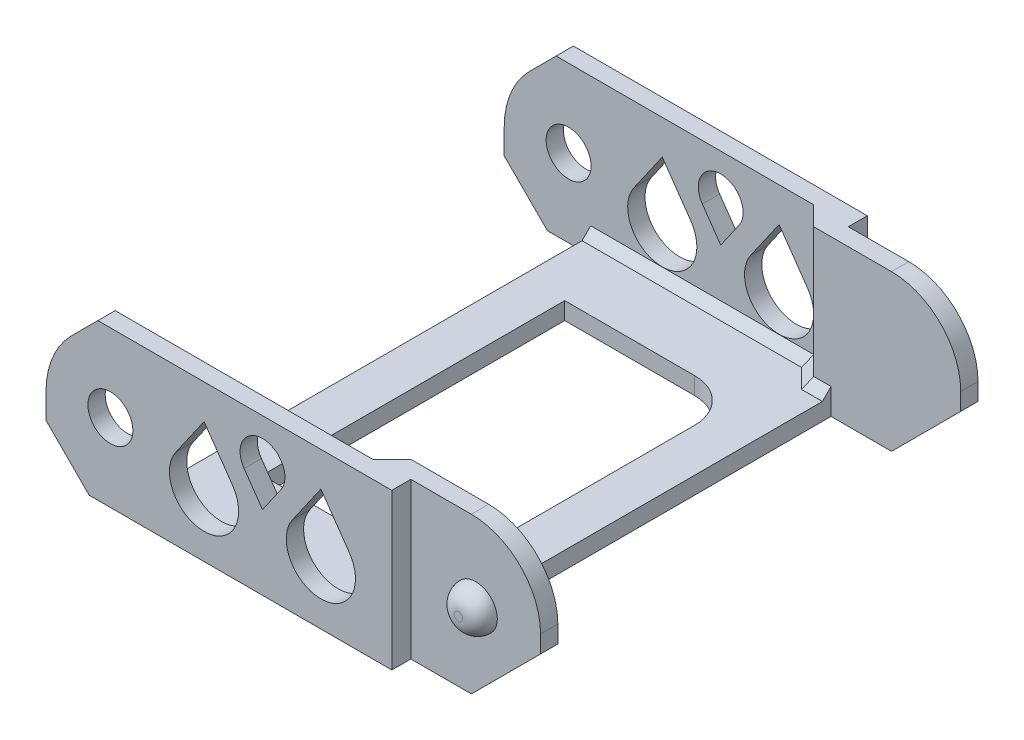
ISO-10303-21;
HEADER;
FILE_DESCRIPTION(('STEP AP214'),'2;1');
FILE_NAME('part.step','',(''),(''),'','','');
FILE_SCHEMA(('AUTOMOTIVE_DESIGN { 1 0 10303 214 1 1 1 1 }'));
ENDSEC;
DATA;
#1=APPLICATION_CONTEXT('core data for automotive mechanical design processes');
#2=APPLICATION_PROTOCOL_DEFINITION('international standard','automotive_design',2000,#1);
#3=PRODUCT_CONTEXT('',#1,'mechanical');
#4=PRODUCT('Part','Part','',(#3));
#5=PRODUCT_RELATED_PRODUCT_CATEGORY('part','',(#4));
#6=PRODUCT_DEFINITION_FORMATION('','',#4);
#7=PRODUCT_DEFINITION_CONTEXT('part definition',#1,'design');
#8=PRODUCT_DEFINITION('design','',#6,#7);
#9=PRODUCT_DEFINITION_SHAPE('','',#8);
#10=(LENGTH_UNIT() NAMED_UNIT(*) SI_UNIT(.MILLI.,.METRE.));
#11=(NAMED_UNIT(*) PLANE_ANGLE_UNIT() SI_UNIT($,.RADIAN.));
#12=(NAMED_UNIT(*) SI_UNIT($,.STERADIAN.) SOLID_ANGLE_UNIT());
#13=UNCERTAINTY_MEASURE_WITH_UNIT(LENGTH_MEASURE(1.E-05),#10,'distance_accuracy_value','');
#14=(GEOMETRIC_REPRESENTATION_CONTEXT(3) GLOBAL_UNCERTAINTY_ASSIGNED_CONTEXT((#13)) GLOBAL_UNIT_ASSIGNED_CONTEXT((#10,
#11,#12)) REPRESENTATION_CONTEXT('',''));
#15=CARTESIAN_POINT('',(0.,0.,0.));
#16=DIRECTION('',(0.,0.,1.));
#17=DIRECTION('',(1.,0.,0.));
#18=AXIS2_PLACEMENT_3D('',#15,#16,#17);
#19=CARTESIAN_POINT('',(0.,18.,44.3591630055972));
#20=DIRECTION('',(0.,0.,1.));
#21=DIRECTION('',(1.,0.,0.));
#22=AXIS2_PLACEMENT_3D('',#19,#20,#21);
#23=PLANE('',#22);
#24=DIRECTION('',(-1.,0.,0.));
#25=VECTOR('',#24,1.);
#26=CARTESIAN_POINT('',(0.,0.,44.3591630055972));
#27=LINE('',#26,#25);
#28=CARTESIAN_POINT('',(6.99999999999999,0.,44.3591630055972));
#29=VERTEX_POINT('',#28);
#30=CARTESIAN_POINT('',(0.,0.,44.3591630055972));
#31=VERTEX_POINT('',#30);
#32=EDGE_CURVE('E566',#29,#31,#27,.T.);
#33=ORIENTED_EDGE('',*,*,#32,.F.);
#34=DIRECTION('',(0.707106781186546,0.707106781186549,0.));
#35=VECTOR('',#34,1.);
#36=CARTESIAN_POINT('',(12.5,5.50000000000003,44.3591630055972));
#37=LINE('',#36,#35);
#38=CARTESIAN_POINT('',(15.,8.00000000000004,44.3591630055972));
#39=VERTEX_POINT('',#38);
#40=EDGE_CURVE('E728',#29,#39,#37,.T.);
#41=ORIENTED_EDGE('',*,*,#40,.T.);
#42=DIRECTION('',(0.,-1.,0.));
#43=VECTOR('',#42,1.);
#44=CARTESIAN_POINT('',(15.,18.,44.3591630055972));
#45=LINE('',#44,#43);
#46=CARTESIAN_POINT('',(15.,10.,44.3591630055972));
#47=VERTEX_POINT('',#46);
#48=EDGE_CURVE('E587',#47,#39,#45,.T.);
#49=ORIENTED_EDGE('',*,*,#48,.F.);
#50=CARTESIAN_POINT('',(7.,10.,44.3591630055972));
#51=DIRECTION('',(0.,0.,1.));
#52=DIRECTION('',(1.,0.,0.));
#53=AXIS2_PLACEMENT_3D('',#50,#51,#52);
#54=CIRCLE('',#53,8.);
#55=CARTESIAN_POINT('',(7.,18.,44.3591630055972));
#56=VERTEX_POINT('',#55);
#57=EDGE_CURVE('E719',#47,#56,#54,.T.);
#58=ORIENTED_EDGE('',*,*,#57,.T.);
#59=DIRECTION('',(-1.,0.,0.));
#60=VECTOR('',#59,1.);
#61=CARTESIAN_POINT('',(0.,18.,44.3591630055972));
#62=LINE('',#61,#60);
#63=CARTESIAN_POINT('',(0.,18.,44.3591630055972));
#64=VERTEX_POINT('',#63);
#65=EDGE_CURVE('E569',#56,#64,#62,.T.);
#66=ORIENTED_EDGE('',*,*,#65,.T.);
#67=DIRECTION('',(0.,1.,0.));
#68=VECTOR('',#67,1.);
#69=CARTESIAN_POINT('',(0.,2.,44.3591630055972));
#70=LINE('',#69,#68);
#71=EDGE_CURVE('E671',#31,#64,#70,.T.);
#72=ORIENTED_EDGE('',*,*,#71,.F.);
#73=EDGE_LOOP('',(#33,#41,#49,#58,#66,#72));
#74=FACE_BOUND('',#73,.T.);
#75=CARTESIAN_POINT('',(7.5,9.,44.3591630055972));
#76=DIRECTION('',(0.,0.,1.));
#77=DIRECTION('',(1.,0.,0.));
#78=AXIS2_PLACEMENT_3D('',#75,#76,#77);
#79=CIRCLE('',#78,2.5);
#80=CARTESIAN_POINT('',(10.,9.,44.3591630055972));
#81=VERTEX_POINT('',#80);
#82=EDGE_CURVE('E520',#81,#81,#79,.T.);
#83=ORIENTED_EDGE('',*,*,#82,.F.);
#84=EDGE_LOOP('',(#83));
#85=FACE_BOUND('',#84,.T.);
#86=ADVANCED_FACE('F33',(#74,#85),#23,.T.);
#87=CARTESIAN_POINT('',(0.,18.,-6.24083699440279));
#88=DIRECTION('',(0.,0.,-1.));
#89=DIRECTION('',(-1.,0.,0.));
#90=AXIS2_PLACEMENT_3D('',#87,#88,#89);
#91=PLANE('',#90);
#92=DIRECTION('',(1.,0.,0.));
#93=VECTOR('',#92,1.);
#94=CARTESIAN_POINT('',(0.,18.,-6.24083699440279));
#95=LINE('',#94,#93);
#96=CARTESIAN_POINT('',(0.,18.,-6.24083699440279));
#97=VERTEX_POINT('',#96);
#98=CARTESIAN_POINT('',(7.,18.,-6.24083699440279));
#99=VERTEX_POINT('',#98);
#100=EDGE_CURVE('E533',#97,#99,#95,.T.);
#101=ORIENTED_EDGE('',*,*,#100,.T.);
#102=CARTESIAN_POINT('',(7.,10.,-6.24083699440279));
#103=DIRECTION('',(0.,0.,-1.));
#104=DIRECTION('',(-1.,0.,0.));
#105=AXIS2_PLACEMENT_3D('',#102,#103,#104);
#106=CIRCLE('',#105,8.);
#107=CARTESIAN_POINT('',(15.,10.,-6.24083699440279));
#108=VERTEX_POINT('',#107);
#109=EDGE_CURVE('E708',#99,#108,#106,.T.);
#110=ORIENTED_EDGE('',*,*,#109,.T.);
#111=DIRECTION('',(0.,-1.,0.));
#112=VECTOR('',#111,1.);
#113=CARTESIAN_POINT('',(15.,18.,-6.24083699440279));
#114=LINE('',#113,#112);
#115=CARTESIAN_POINT('',(15.,8.00000000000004,-6.24083699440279));
#116=VERTEX_POINT('',#115);
#117=EDGE_CURVE('E560',#108,#116,#114,.T.);
#118=ORIENTED_EDGE('',*,*,#117,.T.);
#119=DIRECTION('',(-0.707106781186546,-0.707106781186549,0.));
#120=VECTOR('',#119,1.);
#121=CARTESIAN_POINT('',(12.5,5.50000000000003,-6.24083699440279));
#122=LINE('',#121,#120);
#123=CARTESIAN_POINT('',(6.99999999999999,0.,-6.24083699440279));
#124=VERTEX_POINT('',#123);
#125=EDGE_CURVE('E699',#116,#124,#122,.T.);
#126=ORIENTED_EDGE('',*,*,#125,.T.);
#127=DIRECTION('',(1.,0.,0.));
#128=VECTOR('',#127,1.);
#129=CARTESIAN_POINT('',(0.,0.,-6.24083699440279));
#130=LINE('',#129,#128);
#131=CARTESIAN_POINT('',(0.,0.,-6.24083699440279));
#132=VERTEX_POINT('',#131);
#133=EDGE_CURVE('E526',#132,#124,#130,.T.);
#134=ORIENTED_EDGE('',*,*,#133,.F.);
#135=DIRECTION('',(0.,-1.,0.));
#136=VECTOR('',#135,1.);
#137=CARTESIAN_POINT('',(0.,18.,-6.24083699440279));
#138=LINE('',#137,#136);
#139=EDGE_CURVE('E541',#97,#132,#138,.T.);
#140=ORIENTED_EDGE('',*,*,#139,.F.);
#141=EDGE_LOOP('',(#101,#110,#118,#126,#134,#140));
#142=FACE_BOUND('',#141,.T.);
#143=CARTESIAN_POINT('',(7.5,9.,-6.24083699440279));
#144=DIRECTION('',(0.,0.,-1.));
#145=DIRECTION('',(-1.,0.,0.));
#146=AXIS2_PLACEMENT_3D('',#143,#144,#145);
#147=CIRCLE('',#146,2.5);
#148=CARTESIAN_POINT('',(5.,9.,-6.24083699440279));
#149=VERTEX_POINT('',#148);
#150=EDGE_CURVE('E523',#149,#149,#147,.T.);
#151=ORIENTED_EDGE('',*,*,#150,.F.);
#152=EDGE_LOOP('',(#151));
#153=FACE_BOUND('',#152,.T.);
#154=ADVANCED_FACE('F945',(#142,#153),#91,.T.);
#155=CARTESIAN_POINT('',(0.,2.,46.5591630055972));
#156=DIRECTION('',(-1.,0.,0.));
#157=DIRECTION('',(0.,0.,1.));
#158=AXIS2_PLACEMENT_3D('',#155,#156,#157);
#159=PLANE('',#158);
#160=DIRECTION('',(0.,0.,-1.));
#161=VECTOR('',#160,1.);
#162=CARTESIAN_POINT('',(0.,0.,46.5591630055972));
#163=LINE('',#162,#161);
#164=CARTESIAN_POINT('',(0.,0.,42.3591630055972));
#165=VERTEX_POINT('',#164);
#166=CARTESIAN_POINT('',(0.,0.,-4.24083699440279));
#167=VERTEX_POINT('',#166);
#168=EDGE_CURVE('E657',#165,#167,#163,.T.);
#169=ORIENTED_EDGE('',*,*,#168,.T.);
#170=DIRECTION('',(0.,1.,0.));
#171=VECTOR('',#170,1.);
#172=CARTESIAN_POINT('',(0.,2.,-4.24083699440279));
#173=LINE('',#172,#171);
#174=CARTESIAN_POINT('',(0.,3.,-4.24083699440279));
#175=VERTEX_POINT('',#174);
#176=EDGE_CURVE('E677',#167,#175,#173,.T.);
#177=ORIENTED_EDGE('',*,*,#176,.T.);
#178=DIRECTION('',(0.,0.707106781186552,-0.707106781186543));
#179=VECTOR('',#178,1.);
#180=CARTESIAN_POINT('',(0.,-22.9,21.6591630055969));
#181=LINE('',#180,#179);
#182=CARTESIAN_POINT('',(0.,2.,-3.2408369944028));
#183=VERTEX_POINT('',#182);
#184=EDGE_CURVE('E829',#175,#183,#181,.F.);
#185=ORIENTED_EDGE('',*,*,#184,.T.);
#186=DIRECTION('',(0.,0.,-1.));
#187=VECTOR('',#186,1.);
#188=CARTESIAN_POINT('',(0.,2.,46.5591630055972));
#189=LINE('',#188,#187);
#190=CARTESIAN_POINT('',(0.,2.,41.3591630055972));
#191=VERTEX_POINT('',#190);
#192=EDGE_CURVE('E643',#191,#183,#189,.T.);
#193=ORIENTED_EDGE('',*,*,#192,.F.);
#194=DIRECTION('',(0.,-0.707106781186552,-0.707106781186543));
#195=VECTOR('',#194,1.);
#196=CARTESIAN_POINT('',(0.,4.59999999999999,43.9591630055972));
#197=LINE('',#196,#195);
#198=CARTESIAN_POINT('',(0.,3.,42.3591630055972));
#199=VERTEX_POINT('',#198);
#200=EDGE_CURVE('E834',#191,#199,#197,.F.);
#201=ORIENTED_EDGE('',*,*,#200,.T.);
#202=DIRECTION('',(0.,-1.,0.));
#203=VECTOR('',#202,1.);
#204=CARTESIAN_POINT('',(0.,2.,42.3591630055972));
#205=LINE('',#204,#203);
#206=EDGE_CURVE('E669',#199,#165,#205,.T.);
#207=ORIENTED_EDGE('',*,*,#206,.T.);
#208=EDGE_LOOP('',(#169,#177,#185,#193,#201,#207));
#209=FACE_BOUND('',#208,.T.);
#210=ADVANCED_FACE('F958',(#209),#159,.F.);
#211=CARTESIAN_POINT('',(0.,0.,46.5591630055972));
#212=VERTEX_POINT('',#211);
#213=EDGE_CURVE('E653',#212,#31,#163,.T.);
#214=ORIENTED_EDGE('',*,*,#213,.T.);
#215=ORIENTED_EDGE('',*,*,#71,.T.);
#216=DIRECTION('',(0.,0.,1.));
#217=VECTOR('',#216,1.);
#218=CARTESIAN_POINT('',(0.,18.,46.5591630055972));
#219=LINE('',#218,#217);
#220=CARTESIAN_POINT('',(0.,18.,46.5591630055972));
#221=VERTEX_POINT('',#220);
#222=EDGE_CURVE('E571',#64,#221,#219,.T.);
#223=ORIENTED_EDGE('',*,*,#222,.T.);
#224=DIRECTION('',(0.,-1.,0.));
#225=VECTOR('',#224,1.);
#226=CARTESIAN_POINT('',(0.,2.,46.5591630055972));
#227=LINE('',#226,#225);
#228=EDGE_CURVE('E664',#221,#212,#227,.T.);
#229=ORIENTED_EDGE('',*,*,#228,.T.);
#230=EDGE_LOOP('',(#214,#215,#223,#229));
#231=FACE_BOUND('',#230,.T.);
#232=ADVANCED_FACE('F962',(#231),#159,.F.);
#233=CARTESIAN_POINT('',(0.,2.,0.));
#234=DIRECTION('',(0.,1.,0.));
#235=DIRECTION('',(0.,0.,1.));
#236=AXIS2_PLACEMENT_3D('',#233,#234,#235);
#237=PLANE('',#236);
#238=ORIENTED_EDGE('',*,*,#192,.T.);
#239=DIRECTION('',(-1.,0.,0.));
#240=VECTOR('',#239,1.);
#241=CARTESIAN_POINT('',(-2.,2.,-3.2408369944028));
#242=LINE('',#241,#240);
#243=CARTESIAN_POINT('',(-2.41421356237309,2.,-3.2408369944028));
#244=VERTEX_POINT('',#243);
#245=EDGE_CURVE('E815',#183,#244,#242,.T.);
#246=ORIENTED_EDGE('',*,*,#245,.T.);
#247=DIRECTION('',(-0.707106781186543,0.,-0.707106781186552));
#248=VECTOR('',#247,1.);
#249=CARTESIAN_POINT('',(0.413311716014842,2.,-0.413311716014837));
#250=LINE('',#249,#248);
#251=CARTESIAN_POINT('',(-4.61421356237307,2.,-5.44083699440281));
#252=VERTEX_POINT('',#251);
#253=EDGE_CURVE('E813',#244,#252,#250,.T.);
#254=ORIENTED_EDGE('',*,*,#253,.T.);
#255=DIRECTION('',(-1.,0.,0.));
#256=VECTOR('',#255,1.);
#257=CARTESIAN_POINT('',(-30.,2.,-5.44083699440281));
#258=LINE('',#257,#256);
#259=CARTESIAN_POINT('',(-30.,2.,-5.44083699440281));
#260=VERTEX_POINT('',#259);
#261=EDGE_CURVE('E811',#252,#260,#258,.T.);
#262=ORIENTED_EDGE('',*,*,#261,.T.);
#263=DIRECTION('',(0.,0.,1.));
#264=VECTOR('',#263,1.);
#265=CARTESIAN_POINT('',(-30.,2.,-8.4408369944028));
#266=LINE('',#265,#264);
#267=CARTESIAN_POINT('',(-30.,2.,43.5591630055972));
#268=VERTEX_POINT('',#267);
#269=EDGE_CURVE('E646',#260,#268,#266,.T.);
#270=ORIENTED_EDGE('',*,*,#269,.T.);
#271=DIRECTION('',(1.,0.,0.));
#272=VECTOR('',#271,1.);
#273=CARTESIAN_POINT('',(-4.20000000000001,2.,43.5591630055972));
#274=LINE('',#273,#272);
#275=CARTESIAN_POINT('',(-4.6142135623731,2.,43.5591630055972));
#276=VERTEX_POINT('',#275);
#277=EDGE_CURVE('E805',#268,#276,#274,.T.);
#278=ORIENTED_EDGE('',*,*,#277,.T.);
#279=DIRECTION('',(0.707106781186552,0.,-0.707106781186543));
#280=VECTOR('',#279,1.);
#281=CARTESIAN_POINT('',(19.4724747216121,2.,19.4724747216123));
#282=LINE('',#281,#280);
#283=CARTESIAN_POINT('',(-2.41421356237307,2.,41.3591630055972));
#284=VERTEX_POINT('',#283);
#285=EDGE_CURVE('E807',#276,#284,#282,.T.);
#286=ORIENTED_EDGE('',*,*,#285,.T.);
#287=DIRECTION('',(1.,0.,0.));
#288=VECTOR('',#287,1.);
#289=CARTESIAN_POINT('',(0.,2.,41.3591630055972));
#290=LINE('',#289,#288);
#291=EDGE_CURVE('E809',#284,#191,#290,.T.);
#292=ORIENTED_EDGE('',*,*,#291,.T.);
#293=EDGE_LOOP('',(#238,#246,#254,#262,#270,#278,#286,#292));
#294=FACE_BOUND('',#293,.T.);
#295=DIRECTION('',(0.,0.,1.));
#296=VECTOR('',#295,1.);
#297=CARTESIAN_POINT('',(-25.,2.,1.5591630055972));
#298=LINE('',#297,#296);
#299=CARTESIAN_POINT('',(-25.,2.,1.5591630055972));
#300=VERTEX_POINT('',#299);
#301=CARTESIAN_POINT('',(-25.,2.,36.5591630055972));
#302=VERTEX_POINT('',#301);
#303=EDGE_CURVE('E600',#300,#302,#298,.T.);
#304=ORIENTED_EDGE('',*,*,#303,.F.);
#305=DIRECTION('',(-1.,0.,0.));
#306=VECTOR('',#305,1.);
#307=CARTESIAN_POINT('',(-25.,2.,1.5591630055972));
#308=LINE('',#307,#306);
#309=CARTESIAN_POINT('',(-10.,2.,1.5591630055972));
#310=VERTEX_POINT('',#309);
#311=EDGE_CURVE('E598',#310,#300,#308,.T.);
#312=ORIENTED_EDGE('',*,*,#311,.F.);
#313=CARTESIAN_POINT('',(-10.,2.,6.5591630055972));
#314=DIRECTION('',(0.,1.,0.));
#315=DIRECTION('',(0.,0.,-1.));
#316=AXIS2_PLACEMENT_3D('',#313,#314,#315);
#317=CIRCLE('',#316,5.);
#318=CARTESIAN_POINT('',(-5.,2.,6.55916300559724));
#319=VERTEX_POINT('',#318);
#320=EDGE_CURVE('E610',#319,#310,#317,.T.);
#321=ORIENTED_EDGE('',*,*,#320,.F.);
#322=DIRECTION('',(0.,0.,-1.));
#323=VECTOR('',#322,1.);
#324=CARTESIAN_POINT('',(-5.,2.,6.55916300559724));
#325=LINE('',#324,#323);
#326=CARTESIAN_POINT('',(-5.,2.,31.5591630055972));
#327=VERTEX_POINT('',#326);
#328=EDGE_CURVE('E607',#327,#319,#325,.T.);
#329=ORIENTED_EDGE('',*,*,#328,.F.);
#330=CARTESIAN_POINT('',(-10.,2.,31.5591630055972));
#331=DIRECTION('',(0.,1.,0.));
#332=DIRECTION('',(0.,0.,1.));
#333=AXIS2_PLACEMENT_3D('',#330,#331,#332);
#334=CIRCLE('',#333,5.);
#335=CARTESIAN_POINT('',(-10.,2.,36.5591630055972));
#336=VERTEX_POINT('',#335);
#337=EDGE_CURVE('E605',#336,#327,#334,.T.);
#338=ORIENTED_EDGE('',*,*,#337,.F.);
#339=DIRECTION('',(1.,0.,0.));
#340=VECTOR('',#339,1.);
#341=CARTESIAN_POINT('',(-25.,2.,36.5591630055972));
#342=LINE('',#341,#340);
#343=EDGE_CURVE('E603',#302,#336,#342,.T.);
#344=ORIENTED_EDGE('',*,*,#343,.F.);
#345=EDGE_LOOP('',(#304,#312,#321,#329,#338,#344));
#346=FACE_BOUND('',#345,.T.);
#347=ADVANCED_FACE('F971',(#294,#346),#237,.T.);
#348=CARTESIAN_POINT('',(0.,0.,0.));
#349=DIRECTION('',(0.,1.,0.));
#350=DIRECTION('',(0.,0.,1.));
#351=AXIS2_PLACEMENT_3D('',#348,#349,#350);
#352=PLANE('',#351);
#353=DIRECTION('',(1.,0.,0.));
#354=VECTOR('',#353,1.);
#355=CARTESIAN_POINT('',(0.,0.,46.5591630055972));
#356=LINE('',#355,#354);
#357=CARTESIAN_POINT('',(-35.,0.,46.5591630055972));
#358=VERTEX_POINT('',#357);
#359=EDGE_CURVE('E642',#358,#212,#356,.T.);
#360=ORIENTED_EDGE('',*,*,#359,.F.);
#361=DIRECTION('',(0.,0.,-1.));
#362=VECTOR('',#361,1.);
#363=CARTESIAN_POINT('',(-35.,0.,44.5591630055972));
#364=LINE('',#363,#362);
#365=CARTESIAN_POINT('',(-35.,0.,44.5591630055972));
#366=VERTEX_POINT('',#365);
#367=EDGE_CURVE('E771',#358,#366,#364,.T.);
#368=ORIENTED_EDGE('',*,*,#367,.T.);
#369=DIRECTION('',(1.,0.,0.));
#370=VECTOR('',#369,1.);
#371=CARTESIAN_POINT('',(-40.,0.,44.5591630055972));
#372=LINE('',#371,#370);
#373=CARTESIAN_POINT('',(-30.,0.,44.5591630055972));
#374=VERTEX_POINT('',#373);
#375=EDGE_CURVE('E551',#366,#374,#372,.T.);
#376=ORIENTED_EDGE('',*,*,#375,.T.);
#377=DIRECTION('',(0.,0.,1.));
#378=VECTOR('',#377,1.);
#379=CARTESIAN_POINT('',(-30.,0.,-8.4408369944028));
#380=LINE('',#379,#378);
#381=CARTESIAN_POINT('',(-30.,0.,-6.44083699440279));
#382=VERTEX_POINT('',#381);
#383=EDGE_CURVE('E647',#382,#374,#380,.T.);
#384=ORIENTED_EDGE('',*,*,#383,.F.);
#385=DIRECTION('',(-1.,0.,0.));
#386=VECTOR('',#385,1.);
#387=CARTESIAN_POINT('',(-40.,0.,-6.44083699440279));
#388=LINE('',#387,#386);
#389=CARTESIAN_POINT('',(-35.,0.,-6.44083699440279));
#390=VERTEX_POINT('',#389);
#391=EDGE_CURVE('E530',#382,#390,#388,.T.);
#392=ORIENTED_EDGE('',*,*,#391,.T.);
#393=DIRECTION('',(0.,0.,-1.));
#394=VECTOR('',#393,1.);
#395=CARTESIAN_POINT('',(-35.,0.,-8.4408369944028));
#396=LINE('',#395,#394);
#397=CARTESIAN_POINT('',(-35.,0.,-8.4408369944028));
#398=VERTEX_POINT('',#397);
#399=EDGE_CURVE('E768',#390,#398,#396,.T.);
#400=ORIENTED_EDGE('',*,*,#399,.T.);
#401=DIRECTION('',(-1.,0.,0.));
#402=VECTOR('',#401,1.);
#403=CARTESIAN_POINT('',(-30.,0.,-8.4408369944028));
#404=LINE('',#403,#402);
#405=CARTESIAN_POINT('',(0.,0.,-8.4408369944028));
#406=VERTEX_POINT('',#405);
#407=EDGE_CURVE('E656',#406,#398,#404,.T.);
#408=ORIENTED_EDGE('',*,*,#407,.F.);
#409=EDGE_CURVE('E652',#132,#406,#163,.T.);
#410=ORIENTED_EDGE('',*,*,#409,.F.);
#411=ORIENTED_EDGE('',*,*,#133,.T.);
#412=DIRECTION('',(0.,0.,1.));
#413=VECTOR('',#412,1.);
#414=CARTESIAN_POINT('',(6.99999999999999,0.,-4.24083699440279));
#415=LINE('',#414,#413);
#416=CARTESIAN_POINT('',(6.99999999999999,0.,-4.24083699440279));
#417=VERTEX_POINT('',#416);
#418=EDGE_CURVE('E690',#124,#417,#415,.T.);
#419=ORIENTED_EDGE('',*,*,#418,.T.);
#420=DIRECTION('',(-1.,0.,0.));
#421=VECTOR('',#420,1.);
#422=CARTESIAN_POINT('',(-2.,0.,-4.24083699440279));
#423=LINE('',#422,#421);
#424=EDGE_CURVE('E544',#417,#167,#423,.T.);
#425=ORIENTED_EDGE('',*,*,#424,.T.);
#426=ORIENTED_EDGE('',*,*,#168,.F.);
#427=DIRECTION('',(1.,0.,0.));
#428=VECTOR('',#427,1.);
#429=CARTESIAN_POINT('',(-2.,0.,42.3591630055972));
#430=LINE('',#429,#428);
#431=CARTESIAN_POINT('',(6.99999999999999,0.,42.3591630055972));
#432=VERTEX_POINT('',#431);
#433=EDGE_CURVE('E579',#165,#432,#430,.T.);
#434=ORIENTED_EDGE('',*,*,#433,.T.);
#435=DIRECTION('',(0.,0.,1.));
#436=VECTOR('',#435,1.);
#437=CARTESIAN_POINT('',(6.99999999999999,0.,44.3591630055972));
#438=LINE('',#437,#436);
#439=EDGE_CURVE('E725',#432,#29,#438,.T.);
#440=ORIENTED_EDGE('',*,*,#439,.T.);
#441=ORIENTED_EDGE('',*,*,#32,.T.);
#442=ORIENTED_EDGE('',*,*,#213,.F.);
#443=EDGE_LOOP('',(#360,#368,#376,#384,#392,#400,#408,#410,#411,#419,#425,#426,#434,#440,#441,#442));
#444=FACE_BOUND('',#443,.T.);
#445=DIRECTION('',(-1.,0.,0.));
#446=VECTOR('',#445,1.);
#447=CARTESIAN_POINT('',(-25.,0.,1.5591630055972));
#448=LINE('',#447,#446);
#449=CARTESIAN_POINT('',(-10.,0.,1.5591630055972));
#450=VERTEX_POINT('',#449);
#451=CARTESIAN_POINT('',(-25.,0.,1.5591630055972));
#452=VERTEX_POINT('',#451);
#453=EDGE_CURVE('E586',#450,#452,#448,.T.);
#454=ORIENTED_EDGE('',*,*,#453,.T.);
#455=DIRECTION('',(0.,0.,1.));
#456=VECTOR('',#455,1.);
#457=CARTESIAN_POINT('',(-25.,0.,1.5591630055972));
#458=LINE('',#457,#456);
#459=CARTESIAN_POINT('',(-25.,0.,36.5591630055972));
#460=VERTEX_POINT('',#459);
#461=EDGE_CURVE('E615',#452,#460,#458,.T.);
#462=ORIENTED_EDGE('',*,*,#461,.T.);
#463=DIRECTION('',(1.,0.,0.));
#464=VECTOR('',#463,1.);
#465=CARTESIAN_POINT('',(-25.,0.,36.5591630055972));
#466=LINE('',#465,#464);
#467=CARTESIAN_POINT('',(-10.,0.,36.5591630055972));
#468=VERTEX_POINT('',#467);
#469=EDGE_CURVE('E618',#460,#468,#466,.T.);
#470=ORIENTED_EDGE('',*,*,#469,.T.);
#471=CARTESIAN_POINT('',(-10.,0.,31.5591630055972));
#472=DIRECTION('',(0.,1.,0.));
#473=DIRECTION('',(0.,0.,1.));
#474=AXIS2_PLACEMENT_3D('',#471,#472,#473);
#475=CIRCLE('',#474,5.);
#476=CARTESIAN_POINT('',(-5.,0.,31.5591630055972));
#477=VERTEX_POINT('',#476);
#478=EDGE_CURVE('E621',#468,#477,#475,.T.);
#479=ORIENTED_EDGE('',*,*,#478,.T.);
#480=DIRECTION('',(0.,0.,-1.));
#481=VECTOR('',#480,1.);
#482=CARTESIAN_POINT('',(-5.,0.,6.55916300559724));
#483=LINE('',#482,#481);
#484=CARTESIAN_POINT('',(-5.,0.,6.55916300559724));
#485=VERTEX_POINT('',#484);
#486=EDGE_CURVE('E624',#477,#485,#483,.T.);
#487=ORIENTED_EDGE('',*,*,#486,.T.);
#488=CARTESIAN_POINT('',(-10.,0.,6.5591630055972));
#489=DIRECTION('',(0.,1.,0.));
#490=DIRECTION('',(0.,0.,-1.));
#491=AXIS2_PLACEMENT_3D('',#488,#489,#490);
#492=CIRCLE('',#491,5.);
#493=EDGE_CURVE('E601',#485,#450,#492,.T.);
#494=ORIENTED_EDGE('',*,*,#493,.T.);
#495=EDGE_LOOP('',(#454,#462,#470,#479,#487,#494));
#496=FACE_BOUND('',#495,.T.);
#497=ADVANCED_FACE('F882',(#444,#496),#352,.F.);
#498=CARTESIAN_POINT('',(0.,2.,46.5591630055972));
#499=DIRECTION('',(0.,0.,-1.));
#500=DIRECTION('',(-1.,0.,0.));
#501=AXIS2_PLACEMENT_3D('',#498,#499,#500);
#502=PLANE('',#501);
#503=DIRECTION('',(0.571394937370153,-0.820675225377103,0.));
#504=VECTOR('',#503,1.);
#505=CARTESIAN_POINT('',(-14.9581861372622,8.58725564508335,46.5591630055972));
#506=LINE('',#505,#504);
#507=CARTESIAN_POINT('',(-17.0852511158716,11.642287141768,46.5591630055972));
#508=VERTEX_POINT('',#507);
#509=CARTESIAN_POINT('',(-14.9581861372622,8.58725564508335,46.5591630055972));
#510=VERTEX_POINT('',#509);
#511=EDGE_CURVE('E412',#508,#510,#506,.T.);
#512=ORIENTED_EDGE('',*,*,#511,.F.);
#513=CARTESIAN_POINT('',(-14.9581861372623,13.1232556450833,46.5591630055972));
#514=DIRECTION('',(0.,0.,1.));
#515=DIRECTION('',(1.,0.,0.));
#516=AXIS2_PLACEMENT_3D('',#513,#514,#515);
#517=CIRCLE('',#516,2.59184743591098);
#518=CARTESIAN_POINT('',(-12.8671645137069,11.5918178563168,46.5591630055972));
#519=VERTEX_POINT('',#518);
#520=EDGE_CURVE('E48',#519,#508,#517,.T.);
#521=ORIENTED_EDGE('',*,*,#520,.F.);
#522=DIRECTION('',(0.571228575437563,0.820791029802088,0.));
#523=VECTOR('',#522,1.);
#524=CARTESIAN_POINT('',(-14.9581861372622,8.58725564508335,46.5591630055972));
#525=LINE('',#524,#523);
#526=EDGE_CURVE('E404',#510,#519,#525,.T.);
#527=ORIENTED_EDGE('',*,*,#526,.F.);
#528=EDGE_LOOP('',(#512,#521,#527));
#529=FACE_BOUND('',#528,.T.);
#530=CARTESIAN_POINT('',(-8.20530645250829,7.0242719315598,46.5591630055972));
#531=DIRECTION('',(0.,0.,1.));
#532=DIRECTION('',(1.,0.,0.));
#533=AXIS2_PLACEMENT_3D('',#530,#531,#532);
#534=CIRCLE('',#533,3.99976455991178);
#535=CARTESIAN_POINT('',(-11.4878609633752,9.3096498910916,46.5591630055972));
#536=VERTEX_POINT('',#535);
#537=CARTESIAN_POINT('',(-4.92279877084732,9.30971715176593,46.5591630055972));
#538=VERTEX_POINT('',#537);
#539=EDGE_CURVE('E443',#536,#538,#534,.T.);
#540=ORIENTED_EDGE('',*,*,#539,.F.);
#541=DIRECTION('',(-0.571394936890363,-0.820675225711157,0.));
#542=VECTOR('',#541,1.);
#543=CARTESIAN_POINT('',(-12.1027353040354,8.4265266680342,46.5591630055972));
#544=LINE('',#543,#542);
#545=CARTESIAN_POINT('',(-8.20530645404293,14.0242719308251,46.5591630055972));
#546=VERTEX_POINT('',#545);
#547=EDGE_CURVE('E441',#546,#536,#544,.T.);
#548=ORIENTED_EDGE('',*,*,#547,.F.);
#549=DIRECTION('',(0.571394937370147,-0.820675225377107,0.));
#550=VECTOR('',#549,1.);
#551=CARTESIAN_POINT('',(1.05005908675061,0.731103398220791,46.5591630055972));
#552=LINE('',#551,#550);
#553=EDGE_CURVE('E447',#546,#538,#552,.T.);
#554=ORIENTED_EDGE('',*,*,#553,.T.);
#555=EDGE_LOOP('',(#540,#548,#554));
#556=FACE_BOUND('',#555,.T.);
#557=CARTESIAN_POINT('',(-21.7177780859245,7.02433919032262,46.5591630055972));
#558=DIRECTION('',(0.,0.,1.));
#559=DIRECTION('',(1.,0.,0.));
#560=AXIS2_PLACEMENT_3D('',#557,#558,#559);
#561=CIRCLE('',#560,3.99976456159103);
#562=CARTESIAN_POINT('',(-24.9446633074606,9.38766911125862,46.5591630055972));
#563=VERTEX_POINT('',#562);
#564=CARTESIAN_POINT('',(-18.4352704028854,9.30978441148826,46.5591630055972));
#565=VERTEX_POINT('',#564);
#566=EDGE_CURVE('E478',#563,#565,#561,.T.);
#567=ORIENTED_EDGE('',*,*,#566,.F.);
#568=DIRECTION('',(-0.571228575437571,-0.820791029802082,0.));
#569=VECTOR('',#568,1.);
#570=CARTESIAN_POINT('',(-21.2066635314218,14.758753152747,46.5591630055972));
#571=LINE('',#570,#569);
#572=CARTESIAN_POINT('',(-21.7177780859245,14.0243391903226,46.5591630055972));
#573=VERTEX_POINT('',#572);
#574=EDGE_CURVE('E476',#573,#563,#571,.T.);
#575=ORIENTED_EDGE('',*,*,#574,.F.);
#576=DIRECTION('',(0.571394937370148,-0.820675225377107,0.));
#577=VECTOR('',#576,1.);
#578=CARTESIAN_POINT('',(-8.0506647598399,-5.60527349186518,46.5591630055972));
#579=LINE('',#578,#577);
#580=EDGE_CURVE('E481',#573,#565,#579,.T.);
#581=ORIENTED_EDGE('',*,*,#580,.T.);
#582=EDGE_LOOP('',(#567,#575,#581));
#583=FACE_BOUND('',#582,.T.);
#584=CARTESIAN_POINT('',(-32.553023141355,9.00039639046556,46.5591630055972));
#585=DIRECTION('',(0.,0.,1.));
#586=DIRECTION('',(1.,0.,0.));
#587=AXIS2_PLACEMENT_3D('',#584,#585,#586);
#588=CIRCLE('',#587,2.6);
#589=CARTESIAN_POINT('',(-29.953023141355,9.00039639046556,46.5591630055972));
#590=VERTEX_POINT('',#589);
#591=EDGE_CURVE('E510',#590,#590,#588,.T.);
#592=ORIENTED_EDGE('',*,*,#591,.F.);
#593=EDGE_LOOP('',(#592));
#594=FACE_BOUND('',#593,.T.);
#595=DIRECTION('',(0.,-1.,0.));
#596=VECTOR('',#595,1.);
#597=CARTESIAN_POINT('',(-40.,18.,46.5591630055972));
#598=LINE('',#597,#596);
#599=CARTESIAN_POINT('',(-40.,7.85786437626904,46.5591630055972));
#600=VERTEX_POINT('',#599);
#601=CARTESIAN_POINT('',(-40.,5.00000000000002,46.5591630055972));
#602=VERTEX_POINT('',#601);
#603=EDGE_CURVE('E583',#600,#602,#598,.T.);
#604=ORIENTED_EDGE('',*,*,#603,.T.);
#605=DIRECTION('',(0.707106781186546,-0.707106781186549,0.));
#606=VECTOR('',#605,1.);
#607=CARTESIAN_POINT('',(-35.,0.,46.5591630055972));
#608=LINE('',#607,#606);
#609=EDGE_CURVE('E778',#602,#358,#608,.T.);
#610=ORIENTED_EDGE('',*,*,#609,.T.);
#611=ORIENTED_EDGE('',*,*,#359,.T.);
#612=ORIENTED_EDGE('',*,*,#228,.F.);
#613=DIRECTION('',(-1.,0.,0.));
#614=VECTOR('',#613,1.);
#615=CARTESIAN_POINT('',(-40.,18.,46.5591630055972));
#616=LINE('',#615,#614);
#617=CARTESIAN_POINT('',(-34.,18.,46.5591630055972));
#618=VERTEX_POINT('',#617);
#619=EDGE_CURVE('E574',#221,#618,#616,.T.);
#620=ORIENTED_EDGE('',*,*,#619,.T.);
#621=DIRECTION('',(0.707106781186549,0.707106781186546,0.));
#622=VECTOR('',#621,1.);
#623=CARTESIAN_POINT('',(-40.,12.,46.5591630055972));
#624=LINE('',#623,#622);
#625=CARTESIAN_POINT('',(-37.0710678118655,14.9289321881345,46.5591630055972));
#626=VERTEX_POINT('',#625);
#627=EDGE_CURVE('E747',#618,#626,#624,.F.);
#628=ORIENTED_EDGE('',*,*,#627,.T.);
#629=CARTESIAN_POINT('',(-30.,7.85786437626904,46.5591630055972));
#630=DIRECTION('',(0.,0.,-1.));
#631=DIRECTION('',(-1.,0.,0.));
#632=AXIS2_PLACEMENT_3D('',#629,#630,#631);
#633=CIRCLE('',#632,10.);
#634=EDGE_CURVE('E757',#626,#600,#633,.F.);
#635=ORIENTED_EDGE('',*,*,#634,.T.);
#636=EDGE_LOOP('',(#604,#610,#611,#612,#620,#628,#635));
#637=FACE_BOUND('',#636,.T.);
#638=ADVANCED_FACE('F417',(#529,#556,#583,#594,#637),#502,.F.);
#639=DIRECTION('',(0.,-1.,0.));
#640=VECTOR('',#639,1.);
#641=CARTESIAN_POINT('',(0.,2.,-8.4408369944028));
#642=LINE('',#641,#640);
#643=CARTESIAN_POINT('',(0.,18.,-8.44083699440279));
#644=VERTEX_POINT('',#643);
#645=EDGE_CURVE('E650',#644,#406,#642,.T.);
#646=ORIENTED_EDGE('',*,*,#645,.F.);
#647=DIRECTION('',(0.,0.,1.));
#648=VECTOR('',#647,1.);
#649=CARTESIAN_POINT('',(0.,18.,-8.44083699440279));
#650=LINE('',#649,#648);
#651=EDGE_CURVE('E529',#644,#97,#650,.T.);
#652=ORIENTED_EDGE('',*,*,#651,.T.);
#653=ORIENTED_EDGE('',*,*,#139,.T.);
#654=ORIENTED_EDGE('',*,*,#409,.T.);
#655=EDGE_LOOP('',(#646,#652,#653,#654));
#656=FACE_BOUND('',#655,.T.);
#657=ADVANCED_FACE('F868',(#656),#159,.F.);
#658=CARTESIAN_POINT('',(-30.,2.,-8.4408369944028));
#659=DIRECTION('',(0.,0.,1.));
#660=DIRECTION('',(1.,0.,0.));
#661=AXIS2_PLACEMENT_3D('',#658,#659,#660);
#662=PLANE('',#661);
#663=DIRECTION('',(0.571228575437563,0.820791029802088,0.));
#664=VECTOR('',#663,1.);
#665=CARTESIAN_POINT('',(-22.9548573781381,-2.90305892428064,-8.4408369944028));
#666=LINE('',#665,#664);
#667=CARTESIAN_POINT('',(-14.9581861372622,8.58725564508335,-8.4408369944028));
#668=VERTEX_POINT('',#667);
#669=CARTESIAN_POINT('',(-12.8671645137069,11.5918178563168,-8.4408369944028));
#670=VERTEX_POINT('',#669);
#671=EDGE_CURVE('E432',#668,#670,#666,.T.);
#672=ORIENTED_EDGE('',*,*,#671,.T.);
#673=CARTESIAN_POINT('',(-14.9581861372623,13.1232556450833,-8.4408369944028));
#674=DIRECTION('',(0.,0.,1.));
#675=DIRECTION('',(1.,0.,0.));
#676=AXIS2_PLACEMENT_3D('',#673,#674,#675);
#677=CIRCLE('',#676,2.59184743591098);
#678=CARTESIAN_POINT('',(-17.0852511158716,11.642287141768,-8.4408369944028));
#679=VERTEX_POINT('',#678);
#680=EDGE_CURVE('E437',#670,#679,#677,.T.);
#681=ORIENTED_EDGE('',*,*,#680,.T.);
#682=DIRECTION('',(0.571394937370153,-0.820675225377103,0.));
#683=VECTOR('',#682,1.);
#684=CARTESIAN_POINT('',(-16.7802610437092,11.2042402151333,-8.4408369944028));
#685=LINE('',#684,#683);
#686=EDGE_CURVE('E428',#679,#668,#685,.T.);
#687=ORIENTED_EDGE('',*,*,#686,.T.);
#688=EDGE_LOOP('',(#672,#681,#687));
#689=FACE_BOUND('',#688,.T.);
#690=DIRECTION('',(0.571394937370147,-0.820675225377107,0.));
#691=VECTOR('',#690,1.);
#692=CARTESIAN_POINT('',(-9.6825654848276,16.1460091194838,-8.4408369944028));
#693=LINE('',#692,#691);
#694=CARTESIAN_POINT('',(-8.20530645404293,14.0242719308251,-8.4408369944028));
#695=VERTEX_POINT('',#694);
#696=CARTESIAN_POINT('',(-4.92279877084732,9.30971715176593,-8.4408369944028));
#697=VERTEX_POINT('',#696);
#698=EDGE_CURVE('E468',#695,#697,#693,.T.);
#699=ORIENTED_EDGE('',*,*,#698,.F.);
#700=DIRECTION('',(-0.571394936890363,-0.820675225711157,0.));
#701=VECTOR('',#700,1.);
#702=CARTESIAN_POINT('',(-20.9596411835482,-4.294347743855,-8.4408369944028));
#703=LINE('',#702,#701);
#704=CARTESIAN_POINT('',(-11.4878609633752,9.3096498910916,-8.4408369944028));
#705=VERTEX_POINT('',#704);
#706=EDGE_CURVE('E473',#695,#705,#703,.T.);
#707=ORIENTED_EDGE('',*,*,#706,.T.);
#708=CARTESIAN_POINT('',(-8.20530645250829,7.0242719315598,-8.4408369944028));
#709=DIRECTION('',(0.,0.,1.));
#710=DIRECTION('',(1.,0.,0.));
#711=AXIS2_PLACEMENT_3D('',#708,#709,#710);
#712=CIRCLE('',#711,3.99976455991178);
#713=EDGE_CURVE('E462',#705,#697,#712,.T.);
#714=ORIENTED_EDGE('',*,*,#713,.T.);
#715=EDGE_LOOP('',(#699,#707,#714));
#716=FACE_BOUND('',#715,.T.);
#717=DIRECTION('',(0.571394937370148,-0.820675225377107,0.));
#718=VECTOR('',#717,1.);
#719=CARTESIAN_POINT('',(-18.7832893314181,9.80963222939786,-8.4408369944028));
#720=LINE('',#719,#718);
#721=CARTESIAN_POINT('',(-21.7177780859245,14.0243391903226,-8.4408369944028));
#722=VERTEX_POINT('',#721);
#723=CARTESIAN_POINT('',(-18.4352704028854,9.30978441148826,-8.4408369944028));
#724=VERTEX_POINT('',#723);
#725=EDGE_CURVE('E502',#722,#724,#720,.T.);
#726=ORIENTED_EDGE('',*,*,#725,.F.);
#727=DIRECTION('',(-0.571228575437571,-0.820791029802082,0.));
#728=VECTOR('',#727,1.);
#729=CARTESIAN_POINT('',(-30.0580075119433,2.04037026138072,-8.4408369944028));
#730=LINE('',#729,#728);
#731=CARTESIAN_POINT('',(-24.9446633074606,9.38766911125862,-8.4408369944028));
#732=VERTEX_POINT('',#731);
#733=EDGE_CURVE('E507',#722,#732,#730,.T.);
#734=ORIENTED_EDGE('',*,*,#733,.T.);
#735=CARTESIAN_POINT('',(-21.7177780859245,7.02433919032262,-8.4408369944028));
#736=DIRECTION('',(0.,0.,1.));
#737=DIRECTION('',(1.,0.,0.));
#738=AXIS2_PLACEMENT_3D('',#735,#736,#737);
#739=CIRCLE('',#738,3.99976456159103);
#740=EDGE_CURVE('E496',#732,#724,#739,.T.);
#741=ORIENTED_EDGE('',*,*,#740,.T.);
#742=EDGE_LOOP('',(#726,#734,#741));
#743=FACE_BOUND('',#742,.T.);
#744=CARTESIAN_POINT('',(-32.553023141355,9.00039639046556,-8.4408369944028));
#745=DIRECTION('',(0.,0.,1.));
#746=DIRECTION('',(1.,0.,0.));
#747=AXIS2_PLACEMENT_3D('',#744,#745,#746);
#748=CIRCLE('',#747,2.6);
#749=CARTESIAN_POINT('',(-29.953023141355,9.00039639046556,-8.4408369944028));
#750=VERTEX_POINT('',#749);
#751=EDGE_CURVE('E517',#750,#750,#748,.T.);
#752=ORIENTED_EDGE('',*,*,#751,.T.);
#753=EDGE_LOOP('',(#752));
#754=FACE_BOUND('',#753,.T.);
#755=ORIENTED_EDGE('',*,*,#407,.T.);
#756=DIRECTION('',(-0.707106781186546,0.707106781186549,0.));
#757=VECTOR('',#756,1.);
#758=CARTESIAN_POINT('',(-35.,0.,-8.4408369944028));
#759=LINE('',#758,#757);
#760=CARTESIAN_POINT('',(-40.,5.00000000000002,-8.4408369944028));
#761=VERTEX_POINT('',#760);
#762=EDGE_CURVE('E780',#398,#761,#759,.T.);
#763=ORIENTED_EDGE('',*,*,#762,.T.);
#764=DIRECTION('',(0.,-1.,0.));
#765=VECTOR('',#764,1.);
#766=CARTESIAN_POINT('',(-40.,18.,-8.4408369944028));
#767=LINE('',#766,#765);
#768=CARTESIAN_POINT('',(-40.,7.85786437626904,-8.4408369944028));
#769=VERTEX_POINT('',#768);
#770=EDGE_CURVE('E548',#769,#761,#767,.T.);
#771=ORIENTED_EDGE('',*,*,#770,.F.);
#772=CARTESIAN_POINT('',(-30.,7.85786437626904,-8.4408369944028));
#773=DIRECTION('',(0.,0.,1.));
#774=DIRECTION('',(1.,0.,0.));
#775=AXIS2_PLACEMENT_3D('',#772,#773,#774);
#776=CIRCLE('',#775,10.);
#777=CARTESIAN_POINT('',(-37.0710678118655,14.9289321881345,-8.4408369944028));
#778=VERTEX_POINT('',#777);
#779=EDGE_CURVE('E762',#769,#778,#776,.F.);
#780=ORIENTED_EDGE('',*,*,#779,.T.);
#781=DIRECTION('',(0.707106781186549,0.707106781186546,0.));
#782=VECTOR('',#781,1.);
#783=CARTESIAN_POINT('',(-40.,12.,-8.4408369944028));
#784=LINE('',#783,#782);
#785=CARTESIAN_POINT('',(-34.,18.,-8.44083699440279));
#786=VERTEX_POINT('',#785);
#787=EDGE_CURVE('E734',#778,#786,#784,.T.);
#788=ORIENTED_EDGE('',*,*,#787,.T.);
#789=DIRECTION('',(1.,0.,0.));
#790=VECTOR('',#789,1.);
#791=CARTESIAN_POINT('',(-40.,18.,-8.4408369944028));
#792=LINE('',#791,#790);
#793=EDGE_CURVE('E527',#786,#644,#792,.T.);
#794=ORIENTED_EDGE('',*,*,#793,.T.);
#795=ORIENTED_EDGE('',*,*,#645,.T.);
#796=EDGE_LOOP('',(#755,#763,#771,#780,#788,#794,#795));
#797=FACE_BOUND('',#796,.T.);
#798=ADVANCED_FACE('F864',(#689,#716,#743,#754,#797),#662,.F.);
#799=CARTESIAN_POINT('',(-30.,2.,-8.4408369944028));
#800=DIRECTION('',(1.,0.,0.));
#801=DIRECTION('',(0.,0.,-1.));
#802=AXIS2_PLACEMENT_3D('',#799,#800,#801);
#803=PLANE('',#802);
#804=ORIENTED_EDGE('',*,*,#269,.F.);
#805=DIRECTION('',(0.,-0.707106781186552,0.707106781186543));
#806=VECTOR('',#805,1.);
#807=CARTESIAN_POINT('',(-30.,3.49999999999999,-6.94083699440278));
#808=LINE('',#807,#806);
#809=CARTESIAN_POINT('',(-30.,3.,-6.44083699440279));
#810=VERTEX_POINT('',#809);
#811=EDGE_CURVE('E831',#260,#810,#808,.F.);
#812=ORIENTED_EDGE('',*,*,#811,.T.);
#813=DIRECTION('',(0.,-1.,0.));
#814=VECTOR('',#813,1.);
#815=CARTESIAN_POINT('',(-30.,2.,-6.44083699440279));
#816=LINE('',#815,#814);
#817=EDGE_CURVE('E674',#810,#382,#816,.T.);
#818=ORIENTED_EDGE('',*,*,#817,.T.);
#819=ORIENTED_EDGE('',*,*,#383,.T.);
#820=DIRECTION('',(0.,1.,0.));
#821=VECTOR('',#820,1.);
#822=CARTESIAN_POINT('',(-30.,2.,44.5591630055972));
#823=LINE('',#822,#821);
#824=CARTESIAN_POINT('',(-30.,3.,44.5591630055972));
#825=VERTEX_POINT('',#824);
#826=EDGE_CURVE('E667',#374,#825,#823,.T.);
#827=ORIENTED_EDGE('',*,*,#826,.T.);
#828=DIRECTION('',(0.,0.707106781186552,0.707106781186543));
#829=VECTOR('',#828,1.);
#830=CARTESIAN_POINT('',(-30.,-24.,17.5591630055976));
#831=LINE('',#830,#829);
#832=EDGE_CURVE('E837',#825,#268,#831,.F.);
#833=ORIENTED_EDGE('',*,*,#832,.T.);
#834=EDGE_LOOP('',(#804,#812,#818,#819,#827,#833));
#835=FACE_BOUND('',#834,.T.);
#836=ADVANCED_FACE('F867',(#835),#803,.F.);
#837=CARTESIAN_POINT('',(-25.,2.,1.5591630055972));
#838=DIRECTION('',(0.,0.,1.));
#839=DIRECTION('',(1.,0.,0.));
#840=AXIS2_PLACEMENT_3D('',#837,#838,#839);
#841=PLANE('',#840);
#842=ORIENTED_EDGE('',*,*,#453,.F.);
#843=DIRECTION('',(0.,-1.,0.));
#844=VECTOR('',#843,1.);
#845=CARTESIAN_POINT('',(-10.,2.,1.5591630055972));
#846=LINE('',#845,#844);
#847=EDGE_CURVE('E612',#310,#450,#846,.T.);
#848=ORIENTED_EDGE('',*,*,#847,.F.);
#849=ORIENTED_EDGE('',*,*,#311,.T.);
#850=DIRECTION('',(0.,-1.,0.));
#851=VECTOR('',#850,1.);
#852=CARTESIAN_POINT('',(-25.,2.,1.5591630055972));
#853=LINE('',#852,#851);
#854=EDGE_CURVE('E639',#300,#452,#853,.T.);
#855=ORIENTED_EDGE('',*,*,#854,.T.);
#856=EDGE_LOOP('',(#842,#848,#849,#855));
#857=FACE_BOUND('',#856,.T.);
#858=ADVANCED_FACE('F1020',(#857),#841,.T.);
#859=CARTESIAN_POINT('',(-25.,2.,1.5591630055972));
#860=DIRECTION('',(1.,0.,0.));
#861=DIRECTION('',(0.,0.,-1.));
#862=AXIS2_PLACEMENT_3D('',#859,#860,#861);
#863=PLANE('',#862);
#864=ORIENTED_EDGE('',*,*,#461,.F.);
#865=ORIENTED_EDGE('',*,*,#854,.F.);
#866=ORIENTED_EDGE('',*,*,#303,.T.);
#867=DIRECTION('',(0.,-1.,0.));
#868=VECTOR('',#867,1.);
#869=CARTESIAN_POINT('',(-25.,2.,36.5591630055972));
#870=LINE('',#869,#868);
#871=EDGE_CURVE('E637',#302,#460,#870,.T.);
#872=ORIENTED_EDGE('',*,*,#871,.T.);
#873=EDGE_LOOP('',(#864,#865,#866,#872));
#874=FACE_BOUND('',#873,.T.);
#875=ADVANCED_FACE('F1016',(#874),#863,.T.);
#876=CARTESIAN_POINT('',(-25.,2.,36.5591630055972));
#877=DIRECTION('',(0.,0.,-1.));
#878=DIRECTION('',(-1.,0.,0.));
#879=AXIS2_PLACEMENT_3D('',#876,#877,#878);
#880=PLANE('',#879);
#881=ORIENTED_EDGE('',*,*,#469,.F.);
#882=ORIENTED_EDGE('',*,*,#871,.F.);
#883=ORIENTED_EDGE('',*,*,#343,.T.);
#884=DIRECTION('',(0.,-1.,0.));
#885=VECTOR('',#884,1.);
#886=CARTESIAN_POINT('',(-10.,2.,36.5591630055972));
#887=LINE('',#886,#885);
#888=EDGE_CURVE('E635',#336,#468,#887,.T.);
#889=ORIENTED_EDGE('',*,*,#888,.T.);
#890=EDGE_LOOP('',(#881,#882,#883,#889));
#891=FACE_BOUND('',#890,.T.);
#892=ADVANCED_FACE('F1012',(#891),#880,.T.);
#893=CARTESIAN_POINT('',(-10.,2.,31.5591630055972));
#894=DIRECTION('',(0.,-1.,0.));
#895=DIRECTION('',(0.,0.,-1.));
#896=AXIS2_PLACEMENT_3D('',#893,#894,#895);
#897=CYLINDRICAL_SURFACE('',#896,5.);
#898=ORIENTED_EDGE('',*,*,#478,.F.);
#899=ORIENTED_EDGE('',*,*,#888,.F.);
#900=ORIENTED_EDGE('',*,*,#337,.T.);
#901=DIRECTION('',(0.,-1.,0.));
#902=VECTOR('',#901,1.);
#903=CARTESIAN_POINT('',(-5.,2.,31.5591630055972));
#904=LINE('',#903,#902);
#905=EDGE_CURVE('E633',#327,#477,#904,.T.);
#906=ORIENTED_EDGE('',*,*,#905,.T.);
#907=EDGE_LOOP('',(#898,#899,#900,#906));
#908=FACE_BOUND('',#907,.T.);
#909=ADVANCED_FACE('F1008',(#908),#897,.F.);
#910=CARTESIAN_POINT('',(-5.,2.,6.55916300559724));
#911=DIRECTION('',(-1.,0.,0.));
#912=DIRECTION('',(0.,0.,1.));
#913=AXIS2_PLACEMENT_3D('',#910,#911,#912);
#914=PLANE('',#913);
#915=ORIENTED_EDGE('',*,*,#486,.F.);
#916=ORIENTED_EDGE('',*,*,#905,.F.);
#917=ORIENTED_EDGE('',*,*,#328,.T.);
#918=DIRECTION('',(0.,-1.,0.));
#919=VECTOR('',#918,1.);
#920=CARTESIAN_POINT('',(-5.,2.,6.55916300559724));
#921=LINE('',#920,#919);
#922=EDGE_CURVE('E631',#319,#485,#921,.T.);
#923=ORIENTED_EDGE('',*,*,#922,.T.);
#924=EDGE_LOOP('',(#915,#916,#917,#923));
#925=FACE_BOUND('',#924,.T.);
#926=ADVANCED_FACE('F1004',(#925),#914,.T.);
#927=CARTESIAN_POINT('',(-10.,2.,6.5591630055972));
#928=DIRECTION('',(0.,-1.,0.));
#929=DIRECTION('',(0.,0.,-1.));
#930=AXIS2_PLACEMENT_3D('',#927,#928,#929);
#931=CYLINDRICAL_SURFACE('',#930,5.);
#932=ORIENTED_EDGE('',*,*,#493,.F.);
#933=ORIENTED_EDGE('',*,*,#922,.F.);
#934=ORIENTED_EDGE('',*,*,#320,.T.);
#935=ORIENTED_EDGE('',*,*,#847,.T.);
#936=EDGE_LOOP('',(#932,#933,#934,#935));
#937=FACE_BOUND('',#936,.T.);
#938=ADVANCED_FACE('F1000',(#937),#931,.F.);
#939=CARTESIAN_POINT('',(-40.,18.,44.5591630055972));
#940=DIRECTION('',(-1.,0.,0.));
#941=DIRECTION('',(0.,0.,1.));
#942=AXIS2_PLACEMENT_3D('',#939,#940,#941);
#943=PLANE('',#942);
#944=DIRECTION('',(0.,-1.,0.));
#945=VECTOR('',#944,1.);
#946=CARTESIAN_POINT('',(-40.,18.,44.5591630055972));
#947=LINE('',#946,#945);
#948=CARTESIAN_POINT('',(-40.,7.85786437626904,44.5591630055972));
#949=VERTEX_POINT('',#948);
#950=CARTESIAN_POINT('',(-40.,5.00000000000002,44.5591630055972));
#951=VERTEX_POINT('',#950);
#952=EDGE_CURVE('E577',#949,#951,#947,.T.);
#953=ORIENTED_EDGE('',*,*,#952,.T.);
#954=DIRECTION('',(0.,0.,1.));
#955=VECTOR('',#954,1.);
#956=CARTESIAN_POINT('',(-40.,5.00000000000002,46.5591630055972));
#957=LINE('',#956,#955);
#958=EDGE_CURVE('E776',#951,#602,#957,.T.);
#959=ORIENTED_EDGE('',*,*,#958,.T.);
#960=ORIENTED_EDGE('',*,*,#603,.F.);
#961=DIRECTION('',(0.,0.,1.));
#962=VECTOR('',#961,1.);
#963=CARTESIAN_POINT('',(-40.,7.85786437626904,44.5591630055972));
#964=LINE('',#963,#962);
#965=EDGE_CURVE('E750',#600,#949,#964,.F.);
#966=ORIENTED_EDGE('',*,*,#965,.T.);
#967=EDGE_LOOP('',(#953,#959,#960,#966));
#968=FACE_BOUND('',#967,.T.);
#969=ADVANCED_FACE('F989',(#968),#943,.T.);
#970=CARTESIAN_POINT('',(15.,18.,42.3591630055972));
#971=DIRECTION('',(1.,0.,0.));
#972=DIRECTION('',(0.,0.,-1.));
#973=AXIS2_PLACEMENT_3D('',#970,#971,#972);
#974=PLANE('',#973);
#975=ORIENTED_EDGE('',*,*,#48,.T.);
#976=DIRECTION('',(0.,0.,-1.));
#977=VECTOR('',#976,1.);
#978=CARTESIAN_POINT('',(15.,8.00000000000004,42.3591630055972));
#979=LINE('',#978,#977);
#980=CARTESIAN_POINT('',(15.,8.00000000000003,42.3591630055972));
#981=VERTEX_POINT('',#980);
#982=EDGE_CURVE('E730',#39,#981,#979,.T.);
#983=ORIENTED_EDGE('',*,*,#982,.T.);
#984=DIRECTION('',(0.,-1.,0.));
#985=VECTOR('',#984,1.);
#986=CARTESIAN_POINT('',(15.,18.,42.3591630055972));
#987=LINE('',#986,#985);
#988=CARTESIAN_POINT('',(15.,10.,42.3591630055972));
#989=VERTEX_POINT('',#988);
#990=EDGE_CURVE('E590',#989,#981,#987,.T.);
#991=ORIENTED_EDGE('',*,*,#990,.F.);
#992=DIRECTION('',(0.,0.,1.));
#993=VECTOR('',#992,1.);
#994=CARTESIAN_POINT('',(15.,10.,42.3591630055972));
#995=LINE('',#994,#993);
#996=EDGE_CURVE('E716',#989,#47,#995,.T.);
#997=ORIENTED_EDGE('',*,*,#996,.T.);
#998=EDGE_LOOP('',(#975,#983,#991,#997));
#999=FACE_BOUND('',#998,.T.);
#1000=ADVANCED_FACE('F985',(#999),#974,.T.);
#1001=CARTESIAN_POINT('',(-2.,18.,42.3591630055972));
#1002=DIRECTION('',(0.,0.,-1.));
#1003=DIRECTION('',(-1.,0.,0.));
#1004=AXIS2_PLACEMENT_3D('',#1001,#1002,#1003);
#1005=PLANE('',#1004);
#1006=ORIENTED_EDGE('',*,*,#206,.F.);
#1007=DIRECTION('',(-1.,0.,0.));
#1008=VECTOR('',#1007,1.);
#1009=CARTESIAN_POINT('',(-2.,3.,42.3591630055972));
#1010=LINE('',#1009,#1008);
#1011=CARTESIAN_POINT('',(-2.,3.,42.3591630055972));
#1012=VERTEX_POINT('',#1011);
#1013=EDGE_CURVE('E821',#199,#1012,#1010,.T.);
#1014=ORIENTED_EDGE('',*,*,#1013,.T.);
#1015=DIRECTION('',(0.,-1.,0.));
#1016=VECTOR('',#1015,1.);
#1017=CARTESIAN_POINT('',(-2.,18.,42.3591630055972));
#1018=LINE('',#1017,#1016);
#1019=CARTESIAN_POINT('',(-2.,18.,42.3591630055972));
#1020=VERTEX_POINT('',#1019);
#1021=EDGE_CURVE('E593',#1020,#1012,#1018,.T.);
#1022=ORIENTED_EDGE('',*,*,#1021,.F.);
#1023=DIRECTION('',(1.,0.,0.));
#1024=VECTOR('',#1023,1.);
#1025=CARTESIAN_POINT('',(-2.,18.,42.3591630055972));
#1026=LINE('',#1025,#1024);
#1027=CARTESIAN_POINT('',(7.,18.,42.3591630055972));
#1028=VERTEX_POINT('',#1027);
#1029=EDGE_CURVE('E565',#1020,#1028,#1026,.T.);
#1030=ORIENTED_EDGE('',*,*,#1029,.T.);
#1031=CARTESIAN_POINT('',(7.,10.,42.3591630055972));
#1032=DIRECTION('',(0.,0.,-1.));
#1033=DIRECTION('',(-1.,0.,0.));
#1034=AXIS2_PLACEMENT_3D('',#1031,#1032,#1033);
#1035=CIRCLE('',#1034,8.);
#1036=EDGE_CURVE('E723',#1028,#989,#1035,.T.);
#1037=ORIENTED_EDGE('',*,*,#1036,.T.);
#1038=ORIENTED_EDGE('',*,*,#990,.T.);
#1039=DIRECTION('',(-0.707106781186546,-0.707106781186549,0.));
#1040=VECTOR('',#1039,1.);
#1041=CARTESIAN_POINT('',(11.5,4.50000000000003,42.3591630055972));
#1042=LINE('',#1041,#1040);
#1043=EDGE_CURVE('E732',#981,#432,#1042,.T.);
#1044=ORIENTED_EDGE('',*,*,#1043,.T.);
#1045=ORIENTED_EDGE('',*,*,#433,.F.);
#1046=EDGE_LOOP('',(#1006,#1014,#1022,#1030,#1037,#1038,#1044,#1045));
#1047=FACE_BOUND('',#1046,.T.);
#1048=ADVANCED_FACE('F988',(#1047),#1005,.T.);
#1049=CARTESIAN_POINT('',(-40.,18.,44.5591630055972));
#1050=DIRECTION('',(0.,0.,-1.));
#1051=DIRECTION('',(-1.,0.,0.));
#1052=AXIS2_PLACEMENT_3D('',#1049,#1050,#1051);
#1053=PLANE('',#1052);
#1054=CARTESIAN_POINT('',(-14.9581861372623,13.1232556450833,44.5591630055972));
#1055=DIRECTION('',(0.,0.,-1.));
#1056=DIRECTION('',(-1.,0.,0.));
#1057=AXIS2_PLACEMENT_3D('',#1054,#1055,#1056);
#1058=CIRCLE('',#1057,2.59184743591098);
#1059=CARTESIAN_POINT('',(-17.0852511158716,11.642287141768,44.5591630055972));
#1060=VERTEX_POINT('',#1059);
#1061=CARTESIAN_POINT('',(-12.8671645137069,11.5918178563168,44.5591630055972));
#1062=VERTEX_POINT('',#1061);
#1063=EDGE_CURVE('E435',#1060,#1062,#1058,.T.);
#1064=ORIENTED_EDGE('',*,*,#1063,.F.);
#1065=DIRECTION('',(-0.571394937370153,0.820675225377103,0.));
#1066=VECTOR('',#1065,1.);
#1067=CARTESIAN_POINT('',(-27.548057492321,26.6696621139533,44.5591630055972));
#1068=LINE('',#1067,#1066);
#1069=CARTESIAN_POINT('',(-14.9581861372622,8.58725564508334,44.5591630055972));
#1070=VERTEX_POINT('',#1069);
#1071=EDGE_CURVE('E426',#1070,#1060,#1068,.T.);
#1072=ORIENTED_EDGE('',*,*,#1071,.F.);
#1073=DIRECTION('',(-0.571228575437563,-0.820791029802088,0.));
#1074=VECTOR('',#1073,1.);
#1075=CARTESIAN_POINT('',(-18.71612958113,3.18751480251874,44.5591630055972));
#1076=LINE('',#1075,#1074);
#1077=EDGE_CURVE('E406',#1062,#1070,#1076,.T.);
#1078=ORIENTED_EDGE('',*,*,#1077,.F.);
#1079=EDGE_LOOP('',(#1064,#1072,#1078));
#1080=FACE_BOUND('',#1079,.T.);
#1081=DIRECTION('',(0.571394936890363,0.820675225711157,0.));
#1082=VECTOR('',#1081,1.);
#1083=CARTESIAN_POINT('',(-16.7216882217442,1.79248078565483,44.5591630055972));
#1084=LINE('',#1083,#1082);
#1085=CARTESIAN_POINT('',(-11.4878609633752,9.3096498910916,44.5591630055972));
#1086=VERTEX_POINT('',#1085);
#1087=CARTESIAN_POINT('',(-8.20530645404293,14.0242719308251,44.5591630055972));
#1088=VERTEX_POINT('',#1087);
#1089=EDGE_CURVE('E471',#1086,#1088,#1084,.T.);
#1090=ORIENTED_EDGE('',*,*,#1089,.F.);
#1091=CARTESIAN_POINT('',(-8.20530645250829,7.0242719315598,44.5591630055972));
#1092=DIRECTION('',(0.,0.,-1.));
#1093=DIRECTION('',(-1.,0.,0.));
#1094=AXIS2_PLACEMENT_3D('',#1091,#1092,#1093);
#1095=CIRCLE('',#1094,3.99976455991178);
#1096=CARTESIAN_POINT('',(-4.92279877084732,9.30971715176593,44.5591630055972));
#1097=VERTEX_POINT('',#1096);
#1098=EDGE_CURVE('E460',#1097,#1086,#1095,.T.);
#1099=ORIENTED_EDGE('',*,*,#1098,.F.);
#1100=DIRECTION('',(-0.571394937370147,0.820675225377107,0.));
#1101=VECTOR('',#1100,1.);
#1102=CARTESIAN_POINT('',(-20.4503619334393,31.6114310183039,44.5591630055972));
#1103=LINE('',#1102,#1101);
#1104=EDGE_CURVE('E465',#1097,#1088,#1103,.T.);
#1105=ORIENTED_EDGE('',*,*,#1104,.T.);
#1106=EDGE_LOOP('',(#1090,#1099,#1105));
#1107=FACE_BOUND('',#1106,.T.);
#1108=DIRECTION('',(0.571228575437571,0.820791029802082,0.));
#1109=VECTOR('',#1108,1.);
#1110=CARTESIAN_POINT('',(-25.8192797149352,8.13094398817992,44.5591630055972));
#1111=LINE('',#1110,#1109);
#1112=CARTESIAN_POINT('',(-24.9446633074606,9.38766911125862,44.5591630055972));
#1113=VERTEX_POINT('',#1112);
#1114=CARTESIAN_POINT('',(-21.7177780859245,14.0243391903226,44.5591630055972));
#1115=VERTEX_POINT('',#1114);
#1116=EDGE_CURVE('E505',#1113,#1115,#1111,.T.);
#1117=ORIENTED_EDGE('',*,*,#1116,.F.);
#1118=CARTESIAN_POINT('',(-21.7177780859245,7.02433919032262,44.5591630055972));
#1119=DIRECTION('',(0.,0.,-1.));
#1120=DIRECTION('',(-1.,0.,0.));
#1121=AXIS2_PLACEMENT_3D('',#1118,#1119,#1120);
#1122=CIRCLE('',#1121,3.99976456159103);
#1123=CARTESIAN_POINT('',(-18.4352704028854,9.30978441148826,44.5591630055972));
#1124=VERTEX_POINT('',#1123);
#1125=EDGE_CURVE('E494',#1124,#1113,#1122,.T.);
#1126=ORIENTED_EDGE('',*,*,#1125,.F.);
#1127=DIRECTION('',(-0.571394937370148,0.820675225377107,0.));
#1128=VECTOR('',#1127,1.);
#1129=CARTESIAN_POINT('',(-29.5510857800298,25.2750541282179,44.5591630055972));
#1130=LINE('',#1129,#1128);
#1131=EDGE_CURVE('E499',#1124,#1115,#1130,.T.);
#1132=ORIENTED_EDGE('',*,*,#1131,.T.);
#1133=EDGE_LOOP('',(#1117,#1126,#1132));
#1134=FACE_BOUND('',#1133,.T.);
#1135=CARTESIAN_POINT('',(-32.553023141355,9.00039639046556,44.5591630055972));
#1136=DIRECTION('',(0.,0.,-1.));
#1137=DIRECTION('',(-1.,0.,0.));
#1138=AXIS2_PLACEMENT_3D('',#1135,#1136,#1137);
#1139=CIRCLE('',#1138,2.6);
#1140=CARTESIAN_POINT('',(-35.153023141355,9.00039639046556,44.5591630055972));
#1141=VERTEX_POINT('',#1140);
#1142=EDGE_CURVE('E514',#1141,#1141,#1139,.T.);
#1143=ORIENTED_EDGE('',*,*,#1142,.F.);
#1144=EDGE_LOOP('',(#1143));
#1145=FACE_BOUND('',#1144,.T.);
#1146=DIRECTION('',(0.,-1.,0.));
#1147=VECTOR('',#1146,1.);
#1148=CARTESIAN_POINT('',(-4.20000000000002,2.,44.5591630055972));
#1149=LINE('',#1148,#1147);
#1150=CARTESIAN_POINT('',(-4.20000000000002,18.,44.5591630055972));
#1151=VERTEX_POINT('',#1150);
#1152=CARTESIAN_POINT('',(-4.20000000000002,3.,44.5591630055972));
#1153=VERTEX_POINT('',#1152);
#1154=EDGE_CURVE('E679',#1151,#1153,#1149,.T.);
#1155=ORIENTED_EDGE('',*,*,#1154,.T.);
#1156=DIRECTION('',(-1.,0.,0.));
#1157=VECTOR('',#1156,1.);
#1158=CARTESIAN_POINT('',(-30.,3.,44.5591630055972));
#1159=LINE('',#1158,#1157);
#1160=EDGE_CURVE('E826',#1153,#825,#1159,.T.);
#1161=ORIENTED_EDGE('',*,*,#1160,.T.);
#1162=ORIENTED_EDGE('',*,*,#826,.F.);
#1163=ORIENTED_EDGE('',*,*,#375,.F.);
#1164=DIRECTION('',(-0.707106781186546,0.707106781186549,0.));
#1165=VECTOR('',#1164,1.);
#1166=CARTESIAN_POINT('',(-46.5,11.5,44.5591630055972));
#1167=LINE('',#1166,#1165);
#1168=EDGE_CURVE('E774',#366,#951,#1167,.T.);
#1169=ORIENTED_EDGE('',*,*,#1168,.T.);
#1170=ORIENTED_EDGE('',*,*,#952,.F.);
#1171=CARTESIAN_POINT('',(-30.,7.85786437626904,44.5591630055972));
#1172=DIRECTION('',(0.,0.,-1.));
#1173=DIRECTION('',(-1.,0.,0.));
#1174=AXIS2_PLACEMENT_3D('',#1171,#1172,#1173);
#1175=CIRCLE('',#1174,10.);
#1176=CARTESIAN_POINT('',(-37.0710678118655,14.9289321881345,44.5591630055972));
#1177=VERTEX_POINT('',#1176);
#1178=EDGE_CURVE('E753',#949,#1177,#1175,.T.);
#1179=ORIENTED_EDGE('',*,*,#1178,.T.);
#1180=DIRECTION('',(-0.707106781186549,-0.707106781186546,0.));
#1181=VECTOR('',#1180,1.);
#1182=CARTESIAN_POINT('',(-37.,15.,44.5591630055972));
#1183=LINE('',#1182,#1181);
#1184=CARTESIAN_POINT('',(-34.,18.,44.5591630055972));
#1185=VERTEX_POINT('',#1184);
#1186=EDGE_CURVE('E743',#1177,#1185,#1183,.F.);
#1187=ORIENTED_EDGE('',*,*,#1186,.T.);
#1188=DIRECTION('',(1.,0.,0.));
#1189=VECTOR('',#1188,1.);
#1190=CARTESIAN_POINT('',(-40.,18.,44.5591630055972));
#1191=LINE('',#1190,#1189);
#1192=EDGE_CURVE('E563',#1185,#1151,#1191,.T.);
#1193=ORIENTED_EDGE('',*,*,#1192,.T.);
#1194=EDGE_LOOP('',(#1155,#1161,#1162,#1163,#1169,#1170,#1179,#1187,#1193));
#1195=FACE_BOUND('',#1194,.T.);
#1196=ADVANCED_FACE('F993',(#1080,#1107,#1134,#1145,#1195),#1053,.T.);
#1197=CARTESIAN_POINT('',(0.,18.,0.));
#1198=DIRECTION('',(0.,1.,0.));
#1199=DIRECTION('',(0.,0.,1.));
#1200=AXIS2_PLACEMENT_3D('',#1197,#1198,#1199);
#1201=PLANE('',#1200);
#1202=ORIENTED_EDGE('',*,*,#1192,.F.);
#1203=DIRECTION('',(0.,0.,1.));
#1204=VECTOR('',#1203,1.);
#1205=CARTESIAN_POINT('',(-34.,18.,0.));
#1206=LINE('',#1205,#1204);
#1207=EDGE_CURVE('E745',#1185,#618,#1206,.T.);
#1208=ORIENTED_EDGE('',*,*,#1207,.T.);
#1209=ORIENTED_EDGE('',*,*,#619,.F.);
#1210=ORIENTED_EDGE('',*,*,#222,.F.);
#1211=ORIENTED_EDGE('',*,*,#65,.F.);
#1212=DIRECTION('',(0.,0.,1.));
#1213=VECTOR('',#1212,1.);
#1214=CARTESIAN_POINT('',(7.,18.,0.));
#1215=LINE('',#1214,#1213);
#1216=EDGE_CURVE('E721',#56,#1028,#1215,.F.);
#1217=ORIENTED_EDGE('',*,*,#1216,.T.);
#1218=ORIENTED_EDGE('',*,*,#1029,.F.);
#1219=DIRECTION('',(0.707106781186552,0.,-0.707106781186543));
#1220=VECTOR('',#1219,1.);
#1221=CARTESIAN_POINT('',(-4.20000000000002,18.,44.5591630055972));
#1222=LINE('',#1221,#1220);
#1223=EDGE_CURVE('E684',#1020,#1151,#1222,.F.);
#1224=ORIENTED_EDGE('',*,*,#1223,.T.);
#1225=EDGE_LOOP('',(#1202,#1208,#1209,#1210,#1211,#1217,#1218,#1224));
#1226=FACE_BOUND('',#1225,.T.);
#1227=ADVANCED_FACE('F984',(#1226),#1201,.T.);
#1228=CARTESIAN_POINT('',(-40.,18.,-6.44083699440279));
#1229=DIRECTION('',(-1.,0.,0.));
#1230=DIRECTION('',(0.,0.,1.));
#1231=AXIS2_PLACEMENT_3D('',#1228,#1229,#1230);
#1232=PLANE('',#1231);
#1233=ORIENTED_EDGE('',*,*,#770,.T.);
#1234=DIRECTION('',(0.,0.,1.));
#1235=VECTOR('',#1234,1.);
#1236=CARTESIAN_POINT('',(-40.,5.00000000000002,-6.44083699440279));
#1237=LINE('',#1236,#1235);
#1238=CARTESIAN_POINT('',(-40.,5.00000000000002,-6.44083699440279));
#1239=VERTEX_POINT('',#1238);
#1240=EDGE_CURVE('E782',#761,#1239,#1237,.T.);
#1241=ORIENTED_EDGE('',*,*,#1240,.T.);
#1242=DIRECTION('',(0.,-1.,0.));
#1243=VECTOR('',#1242,1.);
#1244=CARTESIAN_POINT('',(-40.,18.,-6.44083699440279));
#1245=LINE('',#1244,#1243);
#1246=CARTESIAN_POINT('',(-40.,7.85786437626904,-6.44083699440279));
#1247=VERTEX_POINT('',#1246);
#1248=EDGE_CURVE('E552',#1247,#1239,#1245,.T.);
#1249=ORIENTED_EDGE('',*,*,#1248,.F.);
#1250=DIRECTION('',(0.,0.,-1.));
#1251=VECTOR('',#1250,1.);
#1252=CARTESIAN_POINT('',(-40.,7.85786437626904,-6.44083699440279));
#1253=LINE('',#1252,#1251);
#1254=EDGE_CURVE('E759',#1247,#769,#1253,.T.);
#1255=ORIENTED_EDGE('',*,*,#1254,.T.);
#1256=EDGE_LOOP('',(#1233,#1241,#1249,#1255));
#1257=FACE_BOUND('',#1256,.T.);
#1258=ADVANCED_FACE('F893',(#1257),#1232,.T.);
#1259=CARTESIAN_POINT('',(-40.,18.,-6.44083699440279));
#1260=DIRECTION('',(0.,0.,1.));
#1261=DIRECTION('',(1.,0.,0.));
#1262=AXIS2_PLACEMENT_3D('',#1259,#1260,#1261);
#1263=PLANE('',#1262);
#1264=CARTESIAN_POINT('',(-14.9581861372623,13.1232556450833,-6.44083699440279));
#1265=DIRECTION('',(0.,0.,1.));
#1266=DIRECTION('',(1.,0.,0.));
#1267=AXIS2_PLACEMENT_3D('',#1264,#1265,#1266);
#1268=CIRCLE('',#1267,2.59184743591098);
#1269=CARTESIAN_POINT('',(-12.8671645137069,11.5918178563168,-6.44083699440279));
#1270=VERTEX_POINT('',#1269);
#1271=CARTESIAN_POINT('',(-17.0852511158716,11.642287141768,-6.44083699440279));
#1272=VERTEX_POINT('',#1271);
#1273=EDGE_CURVE('E12',#1270,#1272,#1268,.T.);
#1274=ORIENTED_EDGE('',*,*,#1273,.F.);
#1275=DIRECTION('',(0.571228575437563,0.820791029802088,0.));
#1276=VECTOR('',#1275,1.);
#1277=CARTESIAN_POINT('',(-18.71612958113,3.18751480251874,-6.44083699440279));
#1278=LINE('',#1277,#1276);
#1279=CARTESIAN_POINT('',(-14.9581861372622,8.58725564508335,-6.44083699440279));
#1280=VERTEX_POINT('',#1279);
#1281=EDGE_CURVE('E41',#1280,#1270,#1278,.T.);
#1282=ORIENTED_EDGE('',*,*,#1281,.F.);
#1283=DIRECTION('',(0.571394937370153,-0.820675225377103,0.));
#1284=VECTOR('',#1283,1.);
#1285=CARTESIAN_POINT('',(-27.548057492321,26.6696621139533,-6.44083699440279));
#1286=LINE('',#1285,#1284);
#1287=EDGE_CURVE('E839',#1272,#1280,#1286,.T.);
#1288=ORIENTED_EDGE('',*,*,#1287,.F.);
#1289=EDGE_LOOP('',(#1274,#1282,#1288));
#1290=FACE_BOUND('',#1289,.T.);
#1291=DIRECTION('',(-0.571394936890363,-0.820675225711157,0.));
#1292=VECTOR('',#1291,1.);
#1293=CARTESIAN_POINT('',(-16.7216882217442,1.79248078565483,-6.44083699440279));
#1294=LINE('',#1293,#1292);
#1295=CARTESIAN_POINT('',(-8.20530645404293,14.0242719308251,-6.44083699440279));
#1296=VERTEX_POINT('',#1295);
#1297=CARTESIAN_POINT('',(-11.4878609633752,9.3096498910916,-6.44083699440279));
#1298=VERTEX_POINT('',#1297);
#1299=EDGE_CURVE('E799',#1296,#1298,#1294,.T.);
#1300=ORIENTED_EDGE('',*,*,#1299,.F.);
#1301=DIRECTION('',(0.571394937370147,-0.820675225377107,0.));
#1302=VECTOR('',#1301,1.);
#1303=CARTESIAN_POINT('',(-20.4503619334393,31.6114310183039,-6.44083699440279));
#1304=LINE('',#1303,#1302);
#1305=CARTESIAN_POINT('',(-4.92279877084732,9.30971715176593,-6.44083699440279));
#1306=VERTEX_POINT('',#1305);
#1307=EDGE_CURVE('E796',#1296,#1306,#1304,.T.);
#1308=ORIENTED_EDGE('',*,*,#1307,.T.);
#1309=CARTESIAN_POINT('',(-8.20530645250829,7.0242719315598,-6.44083699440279));
#1310=DIRECTION('',(0.,0.,1.));
#1311=DIRECTION('',(1.,0.,0.));
#1312=AXIS2_PLACEMENT_3D('',#1309,#1310,#1311);
#1313=CIRCLE('',#1312,3.99976455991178);
#1314=EDGE_CURVE('E794',#1298,#1306,#1313,.T.);
#1315=ORIENTED_EDGE('',*,*,#1314,.F.);
#1316=EDGE_LOOP('',(#1300,#1308,#1315));
#1317=FACE_BOUND('',#1316,.T.);
#1318=DIRECTION('',(-0.571228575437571,-0.820791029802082,0.));
#1319=VECTOR('',#1318,1.);
#1320=CARTESIAN_POINT('',(-25.8192797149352,8.13094398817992,-6.44083699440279));
#1321=LINE('',#1320,#1319);
#1322=CARTESIAN_POINT('',(-21.7177780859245,14.0243391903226,-6.44083699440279));
#1323=VERTEX_POINT('',#1322);
#1324=CARTESIAN_POINT('',(-24.9446633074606,9.38766911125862,-6.44083699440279));
#1325=VERTEX_POINT('',#1324);
#1326=EDGE_CURVE('E791',#1323,#1325,#1321,.T.);
#1327=ORIENTED_EDGE('',*,*,#1326,.F.);
#1328=DIRECTION('',(0.571394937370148,-0.820675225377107,0.));
#1329=VECTOR('',#1328,1.);
#1330=CARTESIAN_POINT('',(-29.5510857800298,25.2750541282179,-6.44083699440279));
#1331=LINE('',#1330,#1329);
#1332=CARTESIAN_POINT('',(-18.4352704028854,9.30978441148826,-6.44083699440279));
#1333=VERTEX_POINT('',#1332);
#1334=EDGE_CURVE('E788',#1323,#1333,#1331,.T.);
#1335=ORIENTED_EDGE('',*,*,#1334,.T.);
#1336=CARTESIAN_POINT('',(-21.7177780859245,7.02433919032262,-6.44083699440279));
#1337=DIRECTION('',(0.,0.,1.));
#1338=DIRECTION('',(1.,0.,0.));
#1339=AXIS2_PLACEMENT_3D('',#1336,#1337,#1338);
#1340=CIRCLE('',#1339,3.99976456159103);
#1341=EDGE_CURVE('E786',#1325,#1333,#1340,.T.);
#1342=ORIENTED_EDGE('',*,*,#1341,.F.);
#1343=EDGE_LOOP('',(#1327,#1335,#1342));
#1344=FACE_BOUND('',#1343,.T.);
#1345=CARTESIAN_POINT('',(-32.553023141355,9.00039639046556,-6.44083699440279));
#1346=DIRECTION('',(0.,0.,1.));
#1347=DIRECTION('',(1.,0.,0.));
#1348=AXIS2_PLACEMENT_3D('',#1345,#1346,#1347);
#1349=CIRCLE('',#1348,2.6);
#1350=CARTESIAN_POINT('',(-29.953023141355,9.00039639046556,-6.44083699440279));
#1351=VERTEX_POINT('',#1350);
#1352=EDGE_CURVE('E513',#1351,#1351,#1349,.T.);
#1353=ORIENTED_EDGE('',*,*,#1352,.F.);
#1354=EDGE_LOOP('',(#1353));
#1355=FACE_BOUND('',#1354,.T.);
#1356=ORIENTED_EDGE('',*,*,#817,.F.);
#1357=DIRECTION('',(1.,0.,0.));
#1358=VECTOR('',#1357,1.);
#1359=CARTESIAN_POINT('',(-4.19999999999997,3.,-6.44083699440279));
#1360=LINE('',#1359,#1358);
#1361=CARTESIAN_POINT('',(-4.19999999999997,3.,-6.44083699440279));
#1362=VERTEX_POINT('',#1361);
#1363=EDGE_CURVE('E819',#810,#1362,#1360,.T.);
#1364=ORIENTED_EDGE('',*,*,#1363,.T.);
#1365=DIRECTION('',(0.,1.,0.));
#1366=VECTOR('',#1365,1.);
#1367=CARTESIAN_POINT('',(-4.19999999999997,18.,-6.44083699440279));
#1368=LINE('',#1367,#1366);
#1369=CARTESIAN_POINT('',(-4.19999999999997,18.,-6.44083699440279));
#1370=VERTEX_POINT('',#1369);
#1371=EDGE_CURVE('E682',#1362,#1370,#1368,.T.);
#1372=ORIENTED_EDGE('',*,*,#1371,.T.);
#1373=DIRECTION('',(-1.,0.,0.));
#1374=VECTOR('',#1373,1.);
#1375=CARTESIAN_POINT('',(-40.,18.,-6.44083699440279));
#1376=LINE('',#1375,#1374);
#1377=CARTESIAN_POINT('',(-34.,18.,-6.44083699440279));
#1378=VERTEX_POINT('',#1377);
#1379=EDGE_CURVE('E538',#1370,#1378,#1376,.T.);
#1380=ORIENTED_EDGE('',*,*,#1379,.T.);
#1381=DIRECTION('',(-0.707106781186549,-0.707106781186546,0.));
#1382=VECTOR('',#1381,1.);
#1383=CARTESIAN_POINT('',(-37.,15.,-6.44083699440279));
#1384=LINE('',#1383,#1382);
#1385=CARTESIAN_POINT('',(-37.0710678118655,14.9289321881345,-6.44083699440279));
#1386=VERTEX_POINT('',#1385);
#1387=EDGE_CURVE('E740',#1378,#1386,#1384,.T.);
#1388=ORIENTED_EDGE('',*,*,#1387,.T.);
#1389=CARTESIAN_POINT('',(-30.,7.85786437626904,-6.44083699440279));
#1390=DIRECTION('',(0.,0.,1.));
#1391=DIRECTION('',(1.,0.,0.));
#1392=AXIS2_PLACEMENT_3D('',#1389,#1390,#1391);
#1393=CIRCLE('',#1392,10.);
#1394=EDGE_CURVE('E766',#1386,#1247,#1393,.T.);
#1395=ORIENTED_EDGE('',*,*,#1394,.T.);
#1396=ORIENTED_EDGE('',*,*,#1248,.T.);
#1397=DIRECTION('',(0.707106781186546,-0.707106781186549,0.));
#1398=VECTOR('',#1397,1.);
#1399=CARTESIAN_POINT('',(-46.5,11.5,-6.44083699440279));
#1400=LINE('',#1399,#1398);
#1401=EDGE_CURVE('E784',#1239,#390,#1400,.T.);
#1402=ORIENTED_EDGE('',*,*,#1401,.T.);
#1403=ORIENTED_EDGE('',*,*,#391,.F.);
#1404=EDGE_LOOP('',(#1356,#1364,#1372,#1380,#1388,#1395,#1396,#1402,#1403));
#1405=FACE_BOUND('',#1404,.T.);
#1406=ADVANCED_FACE('F860',(#1290,#1317,#1344,#1355,#1405),#1263,.T.);
#1407=CARTESIAN_POINT('',(-2.,18.,-4.24083699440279));
#1408=DIRECTION('',(0.,0.,1.));
#1409=DIRECTION('',(1.,0.,0.));
#1410=AXIS2_PLACEMENT_3D('',#1407,#1408,#1409);
#1411=PLANE('',#1410);
#1412=DIRECTION('',(0.,-1.,0.));
#1413=VECTOR('',#1412,1.);
#1414=CARTESIAN_POINT('',(-2.,18.,-4.24083699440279));
#1415=LINE('',#1414,#1413);
#1416=CARTESIAN_POINT('',(-2.,18.,-4.24083699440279));
#1417=VERTEX_POINT('',#1416);
#1418=CARTESIAN_POINT('',(-2.,3.,-4.24083699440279));
#1419=VERTEX_POINT('',#1418);
#1420=EDGE_CURVE('E555',#1417,#1419,#1415,.T.);
#1421=ORIENTED_EDGE('',*,*,#1420,.T.);
#1422=DIRECTION('',(1.,0.,0.));
#1423=VECTOR('',#1422,1.);
#1424=CARTESIAN_POINT('',(0.,3.,-4.24083699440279));
#1425=LINE('',#1424,#1423);
#1426=EDGE_CURVE('E802',#1419,#175,#1425,.T.);
#1427=ORIENTED_EDGE('',*,*,#1426,.T.);
#1428=ORIENTED_EDGE('',*,*,#176,.F.);
#1429=ORIENTED_EDGE('',*,*,#424,.F.);
#1430=DIRECTION('',(0.707106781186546,0.707106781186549,0.));
#1431=VECTOR('',#1430,1.);
#1432=CARTESIAN_POINT('',(11.5,4.50000000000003,-4.24083699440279));
#1433=LINE('',#1432,#1431);
#1434=CARTESIAN_POINT('',(15.,8.00000000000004,-4.24083699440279));
#1435=VERTEX_POINT('',#1434);
#1436=EDGE_CURVE('E693',#417,#1435,#1433,.T.);
#1437=ORIENTED_EDGE('',*,*,#1436,.T.);
#1438=DIRECTION('',(0.,-1.,0.));
#1439=VECTOR('',#1438,1.);
#1440=CARTESIAN_POINT('',(15.,18.,-4.24083699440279));
#1441=LINE('',#1440,#1439);
#1442=CARTESIAN_POINT('',(15.,10.,-4.24083699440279));
#1443=VERTEX_POINT('',#1442);
#1444=EDGE_CURVE('E558',#1443,#1435,#1441,.T.);
#1445=ORIENTED_EDGE('',*,*,#1444,.F.);
#1446=CARTESIAN_POINT('',(7.,10.,-4.24083699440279));
#1447=DIRECTION('',(0.,0.,1.));
#1448=DIRECTION('',(1.,0.,0.));
#1449=AXIS2_PLACEMENT_3D('',#1446,#1447,#1448);
#1450=CIRCLE('',#1449,8.);
#1451=CARTESIAN_POINT('',(7.,18.,-4.24083699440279));
#1452=VERTEX_POINT('',#1451);
#1453=EDGE_CURVE('E704',#1443,#1452,#1450,.T.);
#1454=ORIENTED_EDGE('',*,*,#1453,.T.);
#1455=DIRECTION('',(-1.,0.,0.));
#1456=VECTOR('',#1455,1.);
#1457=CARTESIAN_POINT('',(-2.,18.,-4.24083699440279));
#1458=LINE('',#1457,#1456);
#1459=EDGE_CURVE('E536',#1452,#1417,#1458,.T.);
#1460=ORIENTED_EDGE('',*,*,#1459,.T.);
#1461=EDGE_LOOP('',(#1421,#1427,#1428,#1429,#1437,#1445,#1454,#1460));
#1462=FACE_BOUND('',#1461,.T.);
#1463=ADVANCED_FACE('F933',(#1462),#1411,.T.);
#1464=CARTESIAN_POINT('',(15.,18.,-4.24083699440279));
#1465=DIRECTION('',(1.,0.,0.));
#1466=DIRECTION('',(0.,0.,-1.));
#1467=AXIS2_PLACEMENT_3D('',#1464,#1465,#1466);
#1468=PLANE('',#1467);
#1469=ORIENTED_EDGE('',*,*,#117,.F.);
#1470=DIRECTION('',(0.,0.,1.));
#1471=VECTOR('',#1470,1.);
#1472=CARTESIAN_POINT('',(15.,10.,-4.24083699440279));
#1473=LINE('',#1472,#1471);
#1474=EDGE_CURVE('E701',#108,#1443,#1473,.T.);
#1475=ORIENTED_EDGE('',*,*,#1474,.T.);
#1476=ORIENTED_EDGE('',*,*,#1444,.T.);
#1477=DIRECTION('',(0.,0.,-1.));
#1478=VECTOR('',#1477,1.);
#1479=CARTESIAN_POINT('',(15.,8.00000000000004,-6.24083699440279));
#1480=LINE('',#1479,#1478);
#1481=EDGE_CURVE('E696',#1435,#116,#1480,.T.);
#1482=ORIENTED_EDGE('',*,*,#1481,.T.);
#1483=EDGE_LOOP('',(#1469,#1475,#1476,#1482));
#1484=FACE_BOUND('',#1483,.T.);
#1485=ADVANCED_FACE('F948',(#1484),#1468,.T.);
#1486=CARTESIAN_POINT('',(0.,18.,0.));
#1487=DIRECTION('',(0.,-1.,0.));
#1488=DIRECTION('',(0.,0.,-1.));
#1489=AXIS2_PLACEMENT_3D('',#1486,#1487,#1488);
#1490=PLANE('',#1489);
#1491=ORIENTED_EDGE('',*,*,#793,.F.);
#1492=DIRECTION('',(0.,0.,1.));
#1493=VECTOR('',#1492,1.);
#1494=CARTESIAN_POINT('',(-34.,18.,-6.44083699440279));
#1495=LINE('',#1494,#1493);
#1496=EDGE_CURVE('E738',#786,#1378,#1495,.T.);
#1497=ORIENTED_EDGE('',*,*,#1496,.T.);
#1498=ORIENTED_EDGE('',*,*,#1379,.F.);
#1499=DIRECTION('',(-0.707106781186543,0.,-0.707106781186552));
#1500=VECTOR('',#1499,1.);
#1501=CARTESIAN_POINT('',(1.12041849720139,18.,-1.12041849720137));
#1502=LINE('',#1501,#1500);
#1503=EDGE_CURVE('E687',#1370,#1417,#1502,.F.);
#1504=ORIENTED_EDGE('',*,*,#1503,.T.);
#1505=ORIENTED_EDGE('',*,*,#1459,.F.);
#1506=DIRECTION('',(0.,0.,1.));
#1507=VECTOR('',#1506,1.);
#1508=CARTESIAN_POINT('',(7.,18.,-6.24083699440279));
#1509=LINE('',#1508,#1507);
#1510=EDGE_CURVE('E706',#1452,#99,#1509,.F.);
#1511=ORIENTED_EDGE('',*,*,#1510,.T.);
#1512=ORIENTED_EDGE('',*,*,#100,.F.);
#1513=ORIENTED_EDGE('',*,*,#651,.F.);
#1514=EDGE_LOOP('',(#1491,#1497,#1498,#1504,#1505,#1511,#1512,#1513));
#1515=FACE_BOUND('',#1514,.T.);
#1516=ADVANCED_FACE('F908',(#1515),#1490,.F.);
#1517=CARTESIAN_POINT('',(-4.20000000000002,18.,44.5591630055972));
#1518=DIRECTION('',(-0.707106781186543,0.,-0.707106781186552));
#1519=DIRECTION('',(0.,1.,0.));
#1520=AXIS2_PLACEMENT_3D('',#1517,#1518,#1519);
#1521=PLANE('',#1520);
#1522=ORIENTED_EDGE('',*,*,#1021,.T.);
#1523=DIRECTION('',(0.707106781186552,0.,-0.707106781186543));
#1524=VECTOR('',#1523,1.);
#1525=CARTESIAN_POINT('',(-4.20000000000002,3.,44.5591630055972));
#1526=LINE('',#1525,#1524);
#1527=EDGE_CURVE('E824',#1012,#1153,#1526,.F.);
#1528=ORIENTED_EDGE('',*,*,#1527,.T.);
#1529=ORIENTED_EDGE('',*,*,#1154,.F.);
#1530=ORIENTED_EDGE('',*,*,#1223,.F.);
#1531=EDGE_LOOP('',(#1522,#1528,#1529,#1530));
#1532=FACE_BOUND('',#1531,.T.);
#1533=ADVANCED_FACE('F1055',(#1532),#1521,.T.);
#1534=CARTESIAN_POINT('',(-2.,18.,-4.24083699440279));
#1535=DIRECTION('',(-0.707106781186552,0.,0.707106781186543));
#1536=DIRECTION('',(0.,1.,0.));
#1537=AXIS2_PLACEMENT_3D('',#1534,#1535,#1536);
#1538=PLANE('',#1537);
#1539=ORIENTED_EDGE('',*,*,#1371,.F.);
#1540=DIRECTION('',(-0.707106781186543,0.,-0.707106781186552));
#1541=VECTOR('',#1540,1.);
#1542=CARTESIAN_POINT('',(-2.,3.,-4.24083699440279));
#1543=LINE('',#1542,#1541);
#1544=EDGE_CURVE('E817',#1362,#1419,#1543,.F.);
#1545=ORIENTED_EDGE('',*,*,#1544,.T.);
#1546=ORIENTED_EDGE('',*,*,#1420,.F.);
#1547=ORIENTED_EDGE('',*,*,#1503,.F.);
#1548=EDGE_LOOP('',(#1539,#1545,#1546,#1547));
#1549=FACE_BOUND('',#1548,.T.);
#1550=ADVANCED_FACE('F915',(#1549),#1538,.T.);
#1551=CARTESIAN_POINT('',(7.5,9.,-8.24083699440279));
#1552=DIRECTION('',(0.,0.,-1.));
#1553=DIRECTION('',(-1.,0.,0.));
#1554=AXIS2_PLACEMENT_3D('',#1551,#1552,#1553);
#1555=PLANE('',#1554);
#1556=CARTESIAN_POINT('',(7.5,9.,-8.24083699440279));
#1557=DIRECTION('',(0.,0.,-1.));
#1558=DIRECTION('',(-1.,0.,0.));
#1559=AXIS2_PLACEMENT_3D('',#1556,#1557,#1558);
#1560=CIRCLE('',#1559,0.5);
#1561=CARTESIAN_POINT('',(7.,9.,-8.24083699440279));
#1562=VERTEX_POINT('',#1561);
#1563=EDGE_CURVE('E710',#1562,#1562,#1560,.T.);
#1564=ORIENTED_EDGE('',*,*,#1563,.T.);
#1565=EDGE_LOOP('',(#1564));
#1566=FACE_BOUND('',#1565,.T.);
#1567=ADVANCED_FACE('F1391',(#1566),#1555,.T.);
#1568=CARTESIAN_POINT('',(6.99999999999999,0.,0.));
#1569=DIRECTION('',(0.707106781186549,-0.707106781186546,0.));
#1570=DIRECTION('',(0.,0.,-1.));
#1571=AXIS2_PLACEMENT_3D('',#1568,#1569,#1570);
#1572=PLANE('',#1571);
#1573=ORIENTED_EDGE('',*,*,#125,.F.);
#1574=ORIENTED_EDGE('',*,*,#1481,.F.);
#1575=ORIENTED_EDGE('',*,*,#1436,.F.);
#1576=ORIENTED_EDGE('',*,*,#418,.F.);
#1577=EDGE_LOOP('',(#1573,#1574,#1575,#1576));
#1578=FACE_BOUND('',#1577,.T.);
#1579=ADVANCED_FACE('F953',(#1578),#1572,.T.);
#1580=CARTESIAN_POINT('',(7.,10.,-4.24083699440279));
#1581=DIRECTION('',(0.,0.,-1.));
#1582=DIRECTION('',(-1.,0.,0.));
#1583=AXIS2_PLACEMENT_3D('',#1580,#1581,#1582);
#1584=CYLINDRICAL_SURFACE('',#1583,8.);
#1585=ORIENTED_EDGE('',*,*,#109,.F.);
#1586=ORIENTED_EDGE('',*,*,#1510,.F.);
#1587=ORIENTED_EDGE('',*,*,#1453,.F.);
#1588=ORIENTED_EDGE('',*,*,#1474,.F.);
#1589=EDGE_LOOP('',(#1585,#1586,#1587,#1588));
#1590=FACE_BOUND('',#1589,.T.);
#1591=ADVANCED_FACE('F941',(#1590),#1584,.T.);
#1592=CARTESIAN_POINT('',(7.5,9.,-6.24083699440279));
#1593=DIRECTION('',(0.,0.,-1.));
#1594=DIRECTION('',(-1.,0.,0.));
#1595=AXIS2_PLACEMENT_3D('',#1592,#1593,#1594);
#1596=DEGENERATE_TOROIDAL_SURFACE('',#1595,0.5,2.,.T.);
#1597=ORIENTED_EDGE('',*,*,#150,.T.);
#1598=EDGE_LOOP('',(#1597));
#1599=FACE_BOUND('',#1598,.T.);
#1600=ORIENTED_EDGE('',*,*,#1563,.F.);
#1601=EDGE_LOOP('',(#1600));
#1602=FACE_BOUND('',#1601,.T.);
#1603=ADVANCED_FACE('F1375',(#1599,#1602),#1596,.T.);
#1604=CARTESIAN_POINT('',(7.5,9.,46.3591630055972));
#1605=DIRECTION('',(0.,0.,1.));
#1606=DIRECTION('',(1.,0.,0.));
#1607=AXIS2_PLACEMENT_3D('',#1604,#1605,#1606);
#1608=PLANE('',#1607);
#1609=CARTESIAN_POINT('',(7.5,9.,46.3591630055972));
#1610=DIRECTION('',(0.,0.,1.));
#1611=DIRECTION('',(1.,0.,0.));
#1612=AXIS2_PLACEMENT_3D('',#1609,#1610,#1611);
#1613=CIRCLE('',#1612,0.5);
#1614=CARTESIAN_POINT('',(8.,9.,46.3591630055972));
#1615=VERTEX_POINT('',#1614);
#1616=EDGE_CURVE('E713',#1615,#1615,#1613,.T.);
#1617=ORIENTED_EDGE('',*,*,#1616,.T.);
#1618=EDGE_LOOP('',(#1617));
#1619=FACE_BOUND('',#1618,.T.);
#1620=ADVANCED_FACE('F1366',(#1619),#1608,.T.);
#1621=CARTESIAN_POINT('',(7.5,9.,44.3591630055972));
#1622=DIRECTION('',(0.,0.,1.));
#1623=DIRECTION('',(1.,0.,0.));
#1624=AXIS2_PLACEMENT_3D('',#1621,#1622,#1623);
#1625=DEGENERATE_TOROIDAL_SURFACE('',#1624,0.5,2.,.T.);
#1626=ORIENTED_EDGE('',*,*,#82,.T.);
#1627=EDGE_LOOP('',(#1626));
#1628=FACE_BOUND('',#1627,.T.);
#1629=ORIENTED_EDGE('',*,*,#1616,.F.);
#1630=EDGE_LOOP('',(#1629));
#1631=FACE_BOUND('',#1630,.T.);
#1632=ADVANCED_FACE('F1357',(#1628,#1631),#1625,.T.);
#1633=CARTESIAN_POINT('',(7.,10.,42.3591630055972));
#1634=DIRECTION('',(0.,0.,1.));
#1635=DIRECTION('',(1.,0.,0.));
#1636=AXIS2_PLACEMENT_3D('',#1633,#1634,#1635);
#1637=CYLINDRICAL_SURFACE('',#1636,8.);
#1638=ORIENTED_EDGE('',*,*,#1036,.F.);
#1639=ORIENTED_EDGE('',*,*,#1216,.F.);
#1640=ORIENTED_EDGE('',*,*,#57,.F.);
#1641=ORIENTED_EDGE('',*,*,#996,.F.);
#1642=EDGE_LOOP('',(#1638,#1639,#1640,#1641));
#1643=FACE_BOUND('',#1642,.T.);
#1644=ADVANCED_FACE('F1066',(#1643),#1637,.T.);
#1645=CARTESIAN_POINT('',(6.99999999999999,0.,0.));
#1646=DIRECTION('',(0.707106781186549,-0.707106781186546,0.));
#1647=DIRECTION('',(0.,0.,-1.));
#1648=AXIS2_PLACEMENT_3D('',#1645,#1646,#1647);
#1649=PLANE('',#1648);
#1650=ORIENTED_EDGE('',*,*,#1043,.F.);
#1651=ORIENTED_EDGE('',*,*,#982,.F.);
#1652=ORIENTED_EDGE('',*,*,#40,.F.);
#1653=ORIENTED_EDGE('',*,*,#439,.F.);
#1654=EDGE_LOOP('',(#1650,#1651,#1652,#1653));
#1655=FACE_BOUND('',#1654,.T.);
#1656=ADVANCED_FACE('F1073',(#1655),#1649,.T.);
#1657=CARTESIAN_POINT('',(-32.553023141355,9.00039639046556,-38.4408369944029));
#1658=DIRECTION('',(0.,0.,1.));
#1659=DIRECTION('',(1.,0.,0.));
#1660=AXIS2_PLACEMENT_3D('',#1657,#1658,#1659);
#1661=CYLINDRICAL_SURFACE('',#1660,2.6);
#1662=ORIENTED_EDGE('',*,*,#1352,.T.);
#1663=EDGE_LOOP('',(#1662));
#1664=FACE_BOUND('',#1663,.T.);
#1665=ORIENTED_EDGE('',*,*,#751,.F.);
#1666=EDGE_LOOP('',(#1665));
#1667=FACE_BOUND('',#1666,.T.);
#1668=ADVANCED_FACE('F1318',(#1664,#1667),#1661,.F.);
#1669=ORIENTED_EDGE('',*,*,#1142,.T.);
#1670=EDGE_LOOP('',(#1669));
#1671=FACE_BOUND('',#1670,.T.);
#1672=ORIENTED_EDGE('',*,*,#591,.T.);
#1673=EDGE_LOOP('',(#1672));
#1674=FACE_BOUND('',#1673,.T.);
#1675=ADVANCED_FACE('F1290',(#1671,#1674),#1661,.F.);
#1676=CARTESIAN_POINT('',(-40.,12.,-6.44083699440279));
#1677=DIRECTION('',(-0.707106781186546,0.707106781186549,0.));
#1678=DIRECTION('',(0.,0.,1.));
#1679=AXIS2_PLACEMENT_3D('',#1676,#1677,#1678);
#1680=PLANE('',#1679);
#1681=ORIENTED_EDGE('',*,*,#787,.F.);
#1682=DIRECTION('',(0.,0.,-1.));
#1683=VECTOR('',#1682,1.);
#1684=CARTESIAN_POINT('',(-37.0710678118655,14.9289321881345,-6.44083699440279));
#1685=LINE('',#1684,#1683);
#1686=EDGE_CURVE('E764',#778,#1386,#1685,.F.);
#1687=ORIENTED_EDGE('',*,*,#1686,.T.);
#1688=ORIENTED_EDGE('',*,*,#1387,.F.);
#1689=ORIENTED_EDGE('',*,*,#1496,.F.);
#1690=EDGE_LOOP('',(#1681,#1687,#1688,#1689));
#1691=FACE_BOUND('',#1690,.T.);
#1692=ADVANCED_FACE('F905',(#1691),#1680,.T.);
#1693=CARTESIAN_POINT('',(-40.,12.,44.5591630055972));
#1694=DIRECTION('',(0.707106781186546,-0.707106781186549,0.));
#1695=DIRECTION('',(0.,0.,-1.));
#1696=AXIS2_PLACEMENT_3D('',#1693,#1694,#1695);
#1697=PLANE('',#1696);
#1698=ORIENTED_EDGE('',*,*,#1186,.F.);
#1699=DIRECTION('',(0.,0.,-1.));
#1700=VECTOR('',#1699,1.);
#1701=CARTESIAN_POINT('',(-37.0710678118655,14.9289321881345,44.5591630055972));
#1702=LINE('',#1701,#1700);
#1703=EDGE_CURVE('E755',#1177,#626,#1702,.F.);
#1704=ORIENTED_EDGE('',*,*,#1703,.T.);
#1705=ORIENTED_EDGE('',*,*,#627,.F.);
#1706=ORIENTED_EDGE('',*,*,#1207,.F.);
#1707=EDGE_LOOP('',(#1698,#1704,#1705,#1706));
#1708=FACE_BOUND('',#1707,.T.);
#1709=ADVANCED_FACE('F1082',(#1708),#1697,.F.);
#1710=CARTESIAN_POINT('',(-30.,7.85786437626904,44.5591630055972));
#1711=DIRECTION('',(0.,0.,1.));
#1712=DIRECTION('',(1.,0.,0.));
#1713=AXIS2_PLACEMENT_3D('',#1710,#1711,#1712);
#1714=CYLINDRICAL_SURFACE('',#1713,10.);
#1715=ORIENTED_EDGE('',*,*,#634,.F.);
#1716=ORIENTED_EDGE('',*,*,#1703,.F.);
#1717=ORIENTED_EDGE('',*,*,#1178,.F.);
#1718=ORIENTED_EDGE('',*,*,#965,.F.);
#1719=EDGE_LOOP('',(#1715,#1716,#1717,#1718));
#1720=FACE_BOUND('',#1719,.T.);
#1721=ADVANCED_FACE('F1085',(#1720),#1714,.T.);
#1722=CARTESIAN_POINT('',(-30.,7.85786437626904,-6.44083699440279));
#1723=DIRECTION('',(0.,0.,-1.));
#1724=DIRECTION('',(-1.,0.,0.));
#1725=AXIS2_PLACEMENT_3D('',#1722,#1723,#1724);
#1726=CYLINDRICAL_SURFACE('',#1725,10.);
#1727=ORIENTED_EDGE('',*,*,#1394,.F.);
#1728=ORIENTED_EDGE('',*,*,#1686,.F.);
#1729=ORIENTED_EDGE('',*,*,#779,.F.);
#1730=ORIENTED_EDGE('',*,*,#1254,.F.);
#1731=EDGE_LOOP('',(#1727,#1728,#1729,#1730));
#1732=FACE_BOUND('',#1731,.T.);
#1733=ADVANCED_FACE('F900',(#1732),#1726,.T.);
#1734=CARTESIAN_POINT('',(-35.,0.,0.));
#1735=DIRECTION('',(-0.707106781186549,-0.707106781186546,0.));
#1736=DIRECTION('',(0.,0.,1.));
#1737=AXIS2_PLACEMENT_3D('',#1734,#1735,#1736);
#1738=PLANE('',#1737);
#1739=ORIENTED_EDGE('',*,*,#609,.F.);
#1740=ORIENTED_EDGE('',*,*,#958,.F.);
#1741=ORIENTED_EDGE('',*,*,#1168,.F.);
#1742=ORIENTED_EDGE('',*,*,#367,.F.);
#1743=EDGE_LOOP('',(#1739,#1740,#1741,#1742));
#1744=FACE_BOUND('',#1743,.T.);
#1745=ADVANCED_FACE('F1092',(#1744),#1738,.T.);
#1746=CARTESIAN_POINT('',(-35.,0.,0.));
#1747=DIRECTION('',(-0.707106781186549,-0.707106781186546,0.));
#1748=DIRECTION('',(0.,0.,1.));
#1749=AXIS2_PLACEMENT_3D('',#1746,#1747,#1748);
#1750=PLANE('',#1749);
#1751=ORIENTED_EDGE('',*,*,#1401,.F.);
#1752=ORIENTED_EDGE('',*,*,#1240,.F.);
#1753=ORIENTED_EDGE('',*,*,#762,.F.);
#1754=ORIENTED_EDGE('',*,*,#399,.F.);
#1755=EDGE_LOOP('',(#1751,#1752,#1753,#1754));
#1756=FACE_BOUND('',#1755,.T.);
#1757=ADVANCED_FACE('F889',(#1756),#1750,.T.);
#1758=CARTESIAN_POINT('',(-21.7177780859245,7.02433919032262,-21.4408369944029));
#1759=DIRECTION('',(0.,0.,1.));
#1760=DIRECTION('',(1.,0.,0.));
#1761=AXIS2_PLACEMENT_3D('',#1758,#1759,#1760);
#1762=CYLINDRICAL_SURFACE('',#1761,3.99976456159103);
#1763=DIRECTION('',(0.,0.,1.));
#1764=VECTOR('',#1763,1.);
#1765=CARTESIAN_POINT('',(-24.9446633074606,9.38766911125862,-21.4408369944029));
#1766=LINE('',#1765,#1764);
#1767=EDGE_CURVE('E491',#732,#1325,#1766,.T.);
#1768=ORIENTED_EDGE('',*,*,#1767,.T.);
#1769=ORIENTED_EDGE('',*,*,#1341,.T.);
#1770=DIRECTION('',(0.,0.,1.));
#1771=VECTOR('',#1770,1.);
#1772=CARTESIAN_POINT('',(-18.4352704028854,9.30978441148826,-21.4408369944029));
#1773=LINE('',#1772,#1771);
#1774=EDGE_CURVE('E488',#724,#1333,#1773,.T.);
#1775=ORIENTED_EDGE('',*,*,#1774,.F.);
#1776=ORIENTED_EDGE('',*,*,#740,.F.);
#1777=EDGE_LOOP('',(#1768,#1769,#1775,#1776));
#1778=FACE_BOUND('',#1777,.T.);
#1779=ADVANCED_FACE('F1103',(#1778),#1762,.F.);
#1780=CARTESIAN_POINT('',(-8.0506647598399,-5.60527349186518,-21.4408369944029));
#1781=DIRECTION('',(-0.820675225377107,-0.571394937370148,0.));
#1782=DIRECTION('',(0.571394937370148,-0.820675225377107,0.));
#1783=AXIS2_PLACEMENT_3D('',#1780,#1781,#1782);
#1784=PLANE('',#1783);
#1785=ORIENTED_EDGE('',*,*,#725,.T.);
#1786=ORIENTED_EDGE('',*,*,#1774,.T.);
#1787=ORIENTED_EDGE('',*,*,#1334,.F.);
#1788=DIRECTION('',(0.,0.,1.));
#1789=VECTOR('',#1788,1.);
#1790=CARTESIAN_POINT('',(-21.7177780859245,14.0243391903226,-21.4408369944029));
#1791=LINE('',#1790,#1789);
#1792=EDGE_CURVE('E487',#722,#1323,#1791,.T.);
#1793=ORIENTED_EDGE('',*,*,#1792,.F.);
#1794=EDGE_LOOP('',(#1785,#1786,#1787,#1793));
#1795=FACE_BOUND('',#1794,.T.);
#1796=ADVANCED_FACE('F1197',(#1795),#1784,.T.);
#1797=CARTESIAN_POINT('',(-21.2066635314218,14.758753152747,-21.4408369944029));
#1798=DIRECTION('',(-0.820791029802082,0.571228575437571,0.));
#1799=DIRECTION('',(-0.571228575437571,-0.820791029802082,0.));
#1800=AXIS2_PLACEMENT_3D('',#1797,#1798,#1799);
#1801=PLANE('',#1800);
#1802=ORIENTED_EDGE('',*,*,#1792,.T.);
#1803=ORIENTED_EDGE('',*,*,#1326,.T.);
#1804=ORIENTED_EDGE('',*,*,#1767,.F.);
#1805=ORIENTED_EDGE('',*,*,#733,.F.);
#1806=EDGE_LOOP('',(#1802,#1803,#1804,#1805));
#1807=FACE_BOUND('',#1806,.T.);
#1808=ADVANCED_FACE('F1203',(#1807),#1801,.F.);
#1809=ORIENTED_EDGE('',*,*,#1116,.T.);
#1810=EDGE_CURVE('E485',#1115,#573,#1791,.T.);
#1811=ORIENTED_EDGE('',*,*,#1810,.T.);
#1812=ORIENTED_EDGE('',*,*,#574,.T.);
#1813=EDGE_CURVE('E484',#1113,#563,#1766,.T.);
#1814=ORIENTED_EDGE('',*,*,#1813,.F.);
#1815=EDGE_LOOP('',(#1809,#1811,#1812,#1814));
#1816=FACE_BOUND('',#1815,.T.);
#1817=ADVANCED_FACE('F1194',(#1816),#1801,.F.);
#1818=EDGE_CURVE('E489',#1124,#565,#1773,.T.);
#1819=ORIENTED_EDGE('',*,*,#1818,.T.);
#1820=ORIENTED_EDGE('',*,*,#580,.F.);
#1821=ORIENTED_EDGE('',*,*,#1810,.F.);
#1822=ORIENTED_EDGE('',*,*,#1131,.F.);
#1823=EDGE_LOOP('',(#1819,#1820,#1821,#1822));
#1824=FACE_BOUND('',#1823,.T.);
#1825=ADVANCED_FACE('F1186',(#1824),#1784,.T.);
#1826=ORIENTED_EDGE('',*,*,#1125,.T.);
#1827=ORIENTED_EDGE('',*,*,#1813,.T.);
#1828=ORIENTED_EDGE('',*,*,#566,.T.);
#1829=ORIENTED_EDGE('',*,*,#1818,.F.);
#1830=EDGE_LOOP('',(#1826,#1827,#1828,#1829));
#1831=FACE_BOUND('',#1830,.T.);
#1832=ADVANCED_FACE('F1179',(#1831),#1762,.F.);
#1833=CARTESIAN_POINT('',(-8.20530645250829,7.0242719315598,-21.4408369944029));
#1834=DIRECTION('',(0.,0.,1.));
#1835=DIRECTION('',(1.,0.,0.));
#1836=AXIS2_PLACEMENT_3D('',#1833,#1834,#1835);
#1837=CYLINDRICAL_SURFACE('',#1836,3.99976455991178);
#1838=DIRECTION('',(0.,0.,1.));
#1839=VECTOR('',#1838,1.);
#1840=CARTESIAN_POINT('',(-11.4878609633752,9.3096498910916,-21.4408369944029));
#1841=LINE('',#1840,#1839);
#1842=EDGE_CURVE('E457',#705,#1298,#1841,.T.);
#1843=ORIENTED_EDGE('',*,*,#1842,.T.);
#1844=ORIENTED_EDGE('',*,*,#1314,.T.);
#1845=DIRECTION('',(0.,0.,1.));
#1846=VECTOR('',#1845,1.);
#1847=CARTESIAN_POINT('',(-4.92279877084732,9.30971715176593,-21.4408369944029));
#1848=LINE('',#1847,#1846);
#1849=EDGE_CURVE('E454',#697,#1306,#1848,.T.);
#1850=ORIENTED_EDGE('',*,*,#1849,.F.);
#1851=ORIENTED_EDGE('',*,*,#713,.F.);
#1852=EDGE_LOOP('',(#1843,#1844,#1850,#1851));
#1853=FACE_BOUND('',#1852,.T.);
#1854=ADVANCED_FACE('F1144',(#1853),#1837,.F.);
#1855=CARTESIAN_POINT('',(1.05005908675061,0.731103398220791,-21.4408369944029));
#1856=DIRECTION('',(-0.820675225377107,-0.571394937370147,0.));
#1857=DIRECTION('',(0.571394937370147,-0.820675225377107,0.));
#1858=AXIS2_PLACEMENT_3D('',#1855,#1856,#1857);
#1859=PLANE('',#1858);
#1860=ORIENTED_EDGE('',*,*,#698,.T.);
#1861=ORIENTED_EDGE('',*,*,#1849,.T.);
#1862=ORIENTED_EDGE('',*,*,#1307,.F.);
#1863=DIRECTION('',(0.,0.,1.));
#1864=VECTOR('',#1863,1.);
#1865=CARTESIAN_POINT('',(-8.20530645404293,14.0242719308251,-21.4408369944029));
#1866=LINE('',#1865,#1864);
#1867=EDGE_CURVE('E453',#695,#1296,#1866,.T.);
#1868=ORIENTED_EDGE('',*,*,#1867,.F.);
#1869=EDGE_LOOP('',(#1860,#1861,#1862,#1868));
#1870=FACE_BOUND('',#1869,.T.);
#1871=ADVANCED_FACE('F1153',(#1870),#1859,.T.);
#1872=CARTESIAN_POINT('',(-12.1027353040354,8.4265266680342,-21.4408369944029));
#1873=DIRECTION('',(-0.820675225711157,0.571394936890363,0.));
#1874=DIRECTION('',(-0.571394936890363,-0.820675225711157,0.));
#1875=AXIS2_PLACEMENT_3D('',#1872,#1873,#1874);
#1876=PLANE('',#1875);
#1877=ORIENTED_EDGE('',*,*,#1867,.T.);
#1878=ORIENTED_EDGE('',*,*,#1299,.T.);
#1879=ORIENTED_EDGE('',*,*,#1842,.F.);
#1880=ORIENTED_EDGE('',*,*,#706,.F.);
#1881=EDGE_LOOP('',(#1877,#1878,#1879,#1880));
#1882=FACE_BOUND('',#1881,.T.);
#1883=ADVANCED_FACE('F1159',(#1882),#1876,.F.);
#1884=ORIENTED_EDGE('',*,*,#1089,.T.);
#1885=EDGE_CURVE('E451',#1088,#546,#1866,.T.);
#1886=ORIENTED_EDGE('',*,*,#1885,.T.);
#1887=ORIENTED_EDGE('',*,*,#547,.T.);
#1888=EDGE_CURVE('E450',#1086,#536,#1841,.T.);
#1889=ORIENTED_EDGE('',*,*,#1888,.F.);
#1890=EDGE_LOOP('',(#1884,#1886,#1887,#1889));
#1891=FACE_BOUND('',#1890,.T.);
#1892=ADVANCED_FACE('F1150',(#1891),#1876,.F.);
#1893=EDGE_CURVE('E455',#1097,#538,#1848,.T.);
#1894=ORIENTED_EDGE('',*,*,#1893,.T.);
#1895=ORIENTED_EDGE('',*,*,#553,.F.);
#1896=ORIENTED_EDGE('',*,*,#1885,.F.);
#1897=ORIENTED_EDGE('',*,*,#1104,.F.);
#1898=EDGE_LOOP('',(#1894,#1895,#1896,#1897));
#1899=FACE_BOUND('',#1898,.T.);
#1900=ADVANCED_FACE('F1141',(#1899),#1859,.T.);
#1901=ORIENTED_EDGE('',*,*,#1098,.T.);
#1902=ORIENTED_EDGE('',*,*,#1888,.T.);
#1903=ORIENTED_EDGE('',*,*,#539,.T.);
#1904=ORIENTED_EDGE('',*,*,#1893,.F.);
#1905=EDGE_LOOP('',(#1901,#1902,#1903,#1904));
#1906=FACE_BOUND('',#1905,.T.);
#1907=ADVANCED_FACE('F1114',(#1906),#1837,.F.);
#1908=CARTESIAN_POINT('',(-40.,3.,-6.44083699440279));
#1909=DIRECTION('',(0.,0.707106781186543,0.707106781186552));
#1910=DIRECTION('',(-1.,0.,0.));
#1911=AXIS2_PLACEMENT_3D('',#1908,#1909,#1910);
#1912=PLANE('',#1911);
#1913=ORIENTED_EDGE('',*,*,#811,.F.);
#1914=ORIENTED_EDGE('',*,*,#261,.F.);
#1915=DIRECTION('',(0.28108463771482,0.678598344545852,-0.678598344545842));
#1916=VECTOR('',#1915,1.);
#1917=CARTESIAN_POINT('',(-5.17596408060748,0.643814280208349,-4.08465127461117));
#1918=LINE('',#1917,#1916);
#1919=EDGE_CURVE('E444',#1362,#252,#1918,.F.);
#1920=ORIENTED_EDGE('',*,*,#1919,.F.);
#1921=ORIENTED_EDGE('',*,*,#1363,.F.);
#1922=EDGE_LOOP('',(#1913,#1914,#1920,#1921));
#1923=FACE_BOUND('',#1922,.T.);
#1924=ADVANCED_FACE('F921',(#1923),#1912,.T.);
#1925=CARTESIAN_POINT('',(0.413311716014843,2.,-0.413311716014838));
#1926=DIRECTION('',(-0.500000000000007,0.707106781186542,0.500000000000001));
#1927=DIRECTION('',(0.707106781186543,0.,0.707106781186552));
#1928=AXIS2_PLACEMENT_3D('',#1925,#1926,#1927);
#1929=PLANE('',#1928);
#1930=ORIENTED_EDGE('',*,*,#1919,.T.);
#1931=ORIENTED_EDGE('',*,*,#253,.F.);
#1932=DIRECTION('',(0.28108463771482,0.678598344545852,-0.678598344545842));
#1933=VECTOR('',#1932,1.);
#1934=CARTESIAN_POINT('',(-2.7301470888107,1.23726899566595,-2.47810599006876));
#1935=LINE('',#1934,#1933);
#1936=EDGE_CURVE('E840',#1419,#244,#1935,.F.);
#1937=ORIENTED_EDGE('',*,*,#1936,.F.);
#1938=ORIENTED_EDGE('',*,*,#1544,.F.);
#1939=EDGE_LOOP('',(#1930,#1931,#1937,#1938));
#1940=FACE_BOUND('',#1939,.T.);
#1941=ADVANCED_FACE('F925',(#1940),#1929,.T.);
#1942=CARTESIAN_POINT('',(-2.,3.,-4.24083699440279));
#1943=DIRECTION('',(0.,0.707106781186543,0.707106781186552));
#1944=DIRECTION('',(-1.,0.,0.));
#1945=AXIS2_PLACEMENT_3D('',#1942,#1943,#1944);
#1946=PLANE('',#1945);
#1947=ORIENTED_EDGE('',*,*,#1936,.T.);
#1948=ORIENTED_EDGE('',*,*,#245,.F.);
#1949=ORIENTED_EDGE('',*,*,#184,.F.);
#1950=ORIENTED_EDGE('',*,*,#1426,.F.);
#1951=EDGE_LOOP('',(#1947,#1948,#1949,#1950));
#1952=FACE_BOUND('',#1951,.T.);
#1953=ADVANCED_FACE('F930',(#1952),#1946,.T.);
#1954=CARTESIAN_POINT('',(-40.,3.,44.5591630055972));
#1955=DIRECTION('',(0.,0.707106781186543,-0.707106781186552));
#1956=DIRECTION('',(1.,0.,0.));
#1957=AXIS2_PLACEMENT_3D('',#1954,#1955,#1956);
#1958=PLANE('',#1957);
#1959=ORIENTED_EDGE('',*,*,#832,.F.);
#1960=ORIENTED_EDGE('',*,*,#1160,.F.);
#1961=DIRECTION('',(-0.281084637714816,-0.678598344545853,-0.678598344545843));
#1962=VECTOR('',#1961,1.);
#1963=CARTESIAN_POINT('',(-7.30553958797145,-4.49743579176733,37.06172721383));
#1964=LINE('',#1963,#1962);
#1965=EDGE_CURVE('E843',#276,#1153,#1964,.F.);
#1966=ORIENTED_EDGE('',*,*,#1965,.F.);
#1967=ORIENTED_EDGE('',*,*,#277,.F.);
#1968=EDGE_LOOP('',(#1959,#1960,#1966,#1967));
#1969=FACE_BOUND('',#1968,.T.);
#1970=ADVANCED_FACE('F35',(#1969),#1958,.T.);
#1971=CARTESIAN_POINT('',(19.4724747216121,2.,19.4724747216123));
#1972=DIRECTION('',(-0.5,0.707106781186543,-0.500000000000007));
#1973=DIRECTION('',(-0.707106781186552,0.,0.707106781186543));
#1974=AXIS2_PLACEMENT_3D('',#1971,#1972,#1973);
#1975=PLANE('',#1974);
#1976=ORIENTED_EDGE('',*,*,#1965,.T.);
#1977=ORIENTED_EDGE('',*,*,#1527,.F.);
#1978=DIRECTION('',(-0.281084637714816,-0.678598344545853,-0.678598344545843));
#1979=VECTOR('',#1978,1.);
#1980=CARTESIAN_POINT('',(-4.85972259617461,-3.90398107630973,35.4551819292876));
#1981=LINE('',#1980,#1979);
#1982=EDGE_CURVE('E440',#284,#1012,#1981,.F.);
#1983=ORIENTED_EDGE('',*,*,#1982,.F.);
#1984=ORIENTED_EDGE('',*,*,#285,.F.);
#1985=EDGE_LOOP('',(#1976,#1977,#1983,#1984));
#1986=FACE_BOUND('',#1985,.T.);
#1987=ADVANCED_FACE('F1045',(#1986),#1975,.T.);
#1988=CARTESIAN_POINT('',(-2.,3.,42.3591630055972));
#1989=DIRECTION('',(0.,0.707106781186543,-0.707106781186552));
#1990=DIRECTION('',(1.,0.,0.));
#1991=AXIS2_PLACEMENT_3D('',#1988,#1989,#1990);
#1992=PLANE('',#1991);
#1993=ORIENTED_EDGE('',*,*,#200,.F.);
#1994=ORIENTED_EDGE('',*,*,#291,.F.);
#1995=ORIENTED_EDGE('',*,*,#1982,.T.);
#1996=ORIENTED_EDGE('',*,*,#1013,.F.);
#1997=EDGE_LOOP('',(#1993,#1994,#1995,#1996));
#1998=FACE_BOUND('',#1997,.T.);
#1999=ADVANCED_FACE('F1050',(#1998),#1992,.T.);
#2000=CARTESIAN_POINT('',(-14.9581861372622,8.58725564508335,-21.4408369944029));
#2001=DIRECTION('',(-0.820675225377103,-0.571394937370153,0.));
#2002=DIRECTION('',(0.571394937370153,-0.820675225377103,0.));
#2003=AXIS2_PLACEMENT_3D('',#2000,#2001,#2002);
#2004=PLANE('',#2003);
#2005=DIRECTION('',(0.,0.,1.));
#2006=VECTOR('',#2005,1.);
#2007=CARTESIAN_POINT('',(-17.0852511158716,11.642287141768,-21.4408369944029));
#2008=LINE('',#2007,#2006);
#2009=EDGE_CURVE('E409',#679,#1272,#2008,.T.);
#2010=ORIENTED_EDGE('',*,*,#2009,.T.);
#2011=ORIENTED_EDGE('',*,*,#1287,.T.);
#2012=DIRECTION('',(0.,0.,1.));
#2013=VECTOR('',#2012,1.);
#2014=CARTESIAN_POINT('',(-14.9581861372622,8.58725564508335,-21.4408369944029));
#2015=LINE('',#2014,#2013);
#2016=EDGE_CURVE('E56',#668,#1280,#2015,.T.);
#2017=ORIENTED_EDGE('',*,*,#2016,.F.);
#2018=ORIENTED_EDGE('',*,*,#686,.F.);
#2019=EDGE_LOOP('',(#2010,#2011,#2017,#2018));
#2020=FACE_BOUND('',#2019,.T.);
#2021=ADVANCED_FACE('F862',(#2020),#2004,.F.);
#2022=CARTESIAN_POINT('',(-14.9581861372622,8.58725564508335,-21.4408369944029));
#2023=DIRECTION('',(0.820791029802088,-0.571228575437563,0.));
#2024=DIRECTION('',(0.571228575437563,0.820791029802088,0.));
#2025=AXIS2_PLACEMENT_3D('',#2022,#2023,#2024);
#2026=PLANE('',#2025);
#2027=ORIENTED_EDGE('',*,*,#2016,.T.);
#2028=ORIENTED_EDGE('',*,*,#1281,.T.);
#2029=DIRECTION('',(0.,0.,1.));
#2030=VECTOR('',#2029,1.);
#2031=CARTESIAN_POINT('',(-12.8671645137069,11.5918178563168,-21.4408369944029));
#2032=LINE('',#2031,#2030);
#2033=EDGE_CURVE('E424',#670,#1270,#2032,.T.);
#2034=ORIENTED_EDGE('',*,*,#2033,.F.);
#2035=ORIENTED_EDGE('',*,*,#671,.F.);
#2036=EDGE_LOOP('',(#2027,#2028,#2034,#2035));
#2037=FACE_BOUND('',#2036,.T.);
#2038=ADVANCED_FACE('F853',(#2037),#2026,.F.);
#2039=CARTESIAN_POINT('',(-14.9581861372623,13.1232556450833,-21.4408369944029));
#2040=DIRECTION('',(0.,0.,1.));
#2041=DIRECTION('',(1.,0.,0.));
#2042=AXIS2_PLACEMENT_3D('',#2039,#2040,#2041);
#2043=CYLINDRICAL_SURFACE('',#2042,2.59184743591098);
#2044=ORIENTED_EDGE('',*,*,#2033,.T.);
#2045=ORIENTED_EDGE('',*,*,#1273,.T.);
#2046=ORIENTED_EDGE('',*,*,#2009,.F.);
#2047=ORIENTED_EDGE('',*,*,#680,.F.);
#2048=EDGE_LOOP('',(#2044,#2045,#2046,#2047));
#2049=FACE_BOUND('',#2048,.T.);
#2050=ADVANCED_FACE('F858',(#2049),#2043,.F.);
#2051=ORIENTED_EDGE('',*,*,#1063,.T.);
#2052=EDGE_CURVE('E423',#1062,#519,#2032,.T.);
#2053=ORIENTED_EDGE('',*,*,#2052,.T.);
#2054=ORIENTED_EDGE('',*,*,#520,.T.);
#2055=EDGE_CURVE('E414',#1060,#508,#2008,.T.);
#2056=ORIENTED_EDGE('',*,*,#2055,.F.);
#2057=EDGE_LOOP('',(#2051,#2053,#2054,#2056));
#2058=FACE_BOUND('',#2057,.T.);
#2059=ADVANCED_FACE('F1519',(#2058),#2043,.F.);
#2060=ORIENTED_EDGE('',*,*,#1077,.T.);
#2061=EDGE_CURVE('E399',#1070,#510,#2015,.T.);
#2062=ORIENTED_EDGE('',*,*,#2061,.T.);
#2063=ORIENTED_EDGE('',*,*,#526,.T.);
#2064=ORIENTED_EDGE('',*,*,#2052,.F.);
#2065=EDGE_LOOP('',(#2060,#2062,#2063,#2064));
#2066=FACE_BOUND('',#2065,.T.);
#2067=ADVANCED_FACE('F401',(#2066),#2026,.F.);
#2068=ORIENTED_EDGE('',*,*,#1071,.T.);
#2069=ORIENTED_EDGE('',*,*,#2055,.T.);
#2070=ORIENTED_EDGE('',*,*,#511,.T.);
#2071=ORIENTED_EDGE('',*,*,#2061,.F.);
#2072=EDGE_LOOP('',(#2068,#2069,#2070,#2071));
#2073=FACE_BOUND('',#2072,.T.);
#2074=ADVANCED_FACE('F413',(#2073),#2004,.F.);
#2075=CLOSED_SHELL('',(#86,#154,#210,#232,#347,#497,#638,#657,#798,#836,#858,#875,#892,#909,
#926,#938,#969,#1000,#1048,#1196,#1227,#1258,#1406,#1463,#1485,#1516,#1533,#1550,#1567,#1579,
#1591,#1603,#1620,#1632,#1644,#1656,#1668,#1675,#1692,#1709,#1721,#1733,#1745,#1757,#1779,#1796,
#1808,#1817,#1825,#1832,#1854,#1871,#1883,#1892,#1900,#1907,#1924,#1941,#1953,#1970,#1987,#1999,
#2021,#2038,#2050,#2059,#2067,#2074));
#2076=MANIFOLD_SOLID_BREP('B2',#2075);
#2077=ADVANCED_BREP_SHAPE_REPRESENTATION('',(#18,#2076),#14);
#2078=SHAPE_DEFINITION_REPRESENTATION(#9,#2077);
ENDSEC;
END-ISO-10303-21;
